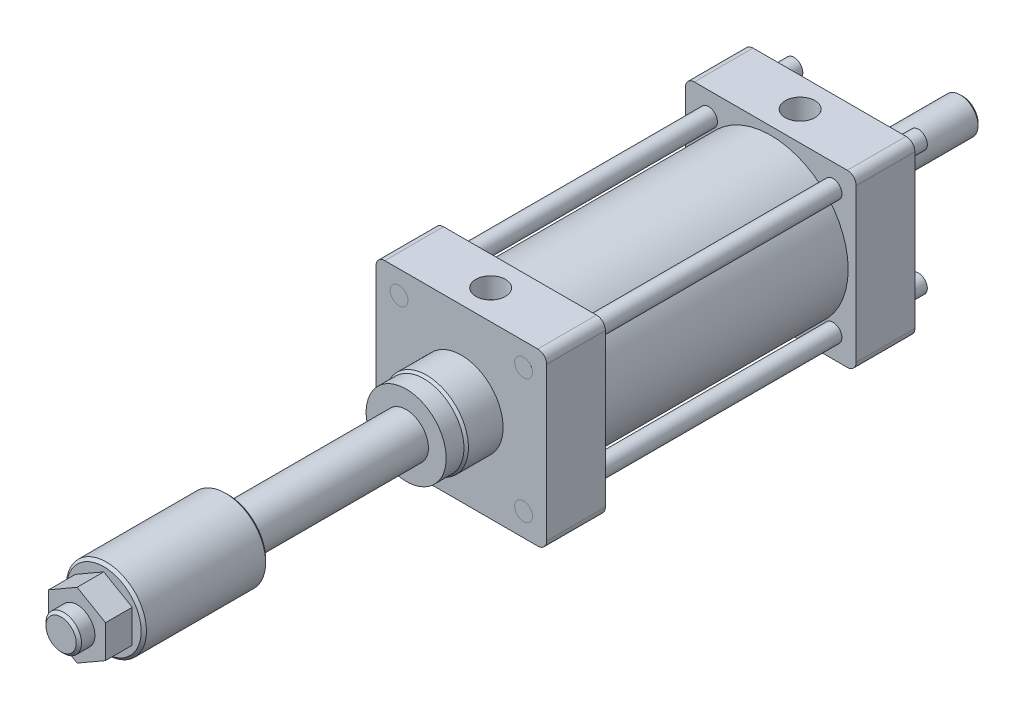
ISO-10303-21;
HEADER;
FILE_DESCRIPTION(('STEP AP214'),'2;1');
FILE_NAME('part.step','',(''),(''),'','','');
FILE_SCHEMA(('AUTOMOTIVE_DESIGN { 1 0 10303 214 1 1 1 1 }'));
ENDSEC;
DATA;
#1=APPLICATION_CONTEXT('core data for automotive mechanical design processes');
#2=APPLICATION_PROTOCOL_DEFINITION('international standard','automotive_design',2000,#1);
#3=PRODUCT_CONTEXT('',#1,'mechanical');
#4=PRODUCT('Part','Part','',(#3));
#5=PRODUCT_RELATED_PRODUCT_CATEGORY('part','',(#4));
#6=PRODUCT_DEFINITION_FORMATION('','',#4);
#7=PRODUCT_DEFINITION_CONTEXT('part definition',#1,'design');
#8=PRODUCT_DEFINITION('design','',#6,#7);
#9=PRODUCT_DEFINITION_SHAPE('','',#8);
#10=(LENGTH_UNIT() NAMED_UNIT(*) SI_UNIT(.MILLI.,.METRE.));
#11=(NAMED_UNIT(*) PLANE_ANGLE_UNIT() SI_UNIT($,.RADIAN.));
#12=(NAMED_UNIT(*) SI_UNIT($,.STERADIAN.) SOLID_ANGLE_UNIT());
#13=UNCERTAINTY_MEASURE_WITH_UNIT(LENGTH_MEASURE(1.E-05),#10,'distance_accuracy_value','');
#14=(GEOMETRIC_REPRESENTATION_CONTEXT(3) GLOBAL_UNCERTAINTY_ASSIGNED_CONTEXT((#13)) GLOBAL_UNIT_ASSIGNED_CONTEXT((#10,
#11,#12)) REPRESENTATION_CONTEXT('',''));
#15=CARTESIAN_POINT('',(0.,0.,0.));
#16=DIRECTION('',(0.,0.,1.));
#17=DIRECTION('',(1.,0.,0.));
#18=AXIS2_PLACEMENT_3D('',#15,#16,#17);
#19=CARTESIAN_POINT('',(-43.,43.,207.));
#20=DIRECTION('',(0.,0.,1.));
#21=DIRECTION('',(1.,0.,0.));
#22=AXIS2_PLACEMENT_3D('',#19,#20,#21);
#23=PLANE('',#22);
#24=CARTESIAN_POINT('',(35.0000000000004,34.9999999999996,207.));
#25=DIRECTION('',(0.,0.,1.));
#26=DIRECTION('',(1.,0.,0.));
#27=AXIS2_PLACEMENT_3D('',#24,#25,#26);
#28=CIRCLE('',#27,5.);
#29=CARTESIAN_POINT('',(40.0000000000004,34.9999999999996,207.));
#30=VERTEX_POINT('',#29);
#31=EDGE_CURVE('E11',#30,#30,#28,.F.);
#32=ORIENTED_EDGE('',*,*,#31,.F.);
#33=EDGE_LOOP('',(#32));
#34=FACE_BOUND('',#33,.T.);
#35=ADVANCED_FACE('F44',(#34),#23,.T.);
#36=CARTESIAN_POINT('',(35.0000000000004,34.9999999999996,221.142135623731));
#37=DIRECTION('',(0.,0.,-1.));
#38=DIRECTION('',(-1.,0.,0.));
#39=AXIS2_PLACEMENT_3D('',#36,#37,#38);
#40=CYLINDRICAL_SURFACE('',#39,5.);
#41=ORIENTED_EDGE('',*,*,#31,.T.);
#42=EDGE_LOOP('',(#41));
#43=FACE_BOUND('',#42,.T.);
#44=CARTESIAN_POINT('',(35.0000000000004,34.9999999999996,-15.));
#45=DIRECTION('',(0.,0.,-1.));
#46=DIRECTION('',(-1.,0.,0.));
#47=AXIS2_PLACEMENT_3D('',#44,#45,#46);
#48=CIRCLE('',#47,5.);
#49=CARTESIAN_POINT('',(30.0000000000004,34.9999999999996,-15.));
#50=VERTEX_POINT('',#49);
#51=EDGE_CURVE('E50',#50,#50,#48,.T.);
#52=ORIENTED_EDGE('',*,*,#51,.F.);
#53=EDGE_LOOP('',(#52));
#54=FACE_BOUND('',#53,.T.);
#55=ADVANCED_FACE('F58',(#43,#54),#40,.T.);
#56=CARTESIAN_POINT('',(35.0000000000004,34.9999999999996,-15.));
#57=DIRECTION('',(0.,0.,-1.));
#58=DIRECTION('',(-1.,0.,0.));
#59=AXIS2_PLACEMENT_3D('',#56,#57,#58);
#60=PLANE('',#59);
#61=ORIENTED_EDGE('',*,*,#51,.T.);
#62=EDGE_LOOP('',(#61));
#63=FACE_BOUND('',#62,.T.);
#64=ADVANCED_FACE('F56',(#63),#60,.T.);
#65=CLOSED_SHELL('',(#35,#55,#64));
#66=MANIFOLD_SOLID_BREP('B2',#65);
#67=CARTESIAN_POINT('',(-43.,43.,207.));
#68=DIRECTION('',(0.,0.,1.));
#69=DIRECTION('',(1.,0.,0.));
#70=AXIS2_PLACEMENT_3D('',#67,#68,#69);
#71=PLANE('',#70);
#72=CARTESIAN_POINT('',(-34.9999999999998,35.0000000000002,207.));
#73=DIRECTION('',(0.,0.,1.));
#74=DIRECTION('',(1.,0.,0.));
#75=AXIS2_PLACEMENT_3D('',#72,#73,#74);
#76=CIRCLE('',#75,5.);
#77=CARTESIAN_POINT('',(-29.9999999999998,35.0000000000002,207.));
#78=VERTEX_POINT('',#77);
#79=EDGE_CURVE('E43',#78,#78,#76,.F.);
#80=ORIENTED_EDGE('',*,*,#79,.F.);
#81=EDGE_LOOP('',(#80));
#82=FACE_BOUND('',#81,.T.);
#83=ADVANCED_FACE('F93',(#82),#71,.T.);
#84=CARTESIAN_POINT('',(-34.9999999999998,35.0000000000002,221.142135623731));
#85=DIRECTION('',(0.,0.,-1.));
#86=DIRECTION('',(-1.,0.,0.));
#87=AXIS2_PLACEMENT_3D('',#84,#85,#86);
#88=CYLINDRICAL_SURFACE('',#87,5.);
#89=ORIENTED_EDGE('',*,*,#79,.T.);
#90=EDGE_LOOP('',(#89));
#91=FACE_BOUND('',#90,.T.);
#92=CARTESIAN_POINT('',(-34.9999999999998,35.0000000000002,-15.));
#93=DIRECTION('',(0.,0.,-1.));
#94=DIRECTION('',(-1.,0.,0.));
#95=AXIS2_PLACEMENT_3D('',#92,#93,#94);
#96=CIRCLE('',#95,5.);
#97=CARTESIAN_POINT('',(-39.9999999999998,35.0000000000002,-15.));
#98=VERTEX_POINT('',#97);
#99=EDGE_CURVE('E99',#98,#98,#96,.T.);
#100=ORIENTED_EDGE('',*,*,#99,.F.);
#101=EDGE_LOOP('',(#100));
#102=FACE_BOUND('',#101,.T.);
#103=ADVANCED_FACE('F107',(#91,#102),#88,.T.);
#104=CARTESIAN_POINT('',(-34.9999999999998,35.0000000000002,-15.));
#105=DIRECTION('',(0.,0.,-1.));
#106=DIRECTION('',(-1.,0.,0.));
#107=AXIS2_PLACEMENT_3D('',#104,#105,#106);
#108=PLANE('',#107);
#109=ORIENTED_EDGE('',*,*,#99,.T.);
#110=EDGE_LOOP('',(#109));
#111=FACE_BOUND('',#110,.T.);
#112=ADVANCED_FACE('F105',(#111),#108,.T.);
#113=CLOSED_SHELL('',(#83,#103,#112));
#114=MANIFOLD_SOLID_BREP('B6',#113);
#115=CARTESIAN_POINT('',(-43.,43.,207.));
#116=DIRECTION('',(0.,0.,1.));
#117=DIRECTION('',(1.,0.,0.));
#118=AXIS2_PLACEMENT_3D('',#115,#116,#117);
#119=PLANE('',#118);
#120=CARTESIAN_POINT('',(-35.0000000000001,-34.9999999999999,207.));
#121=DIRECTION('',(0.,0.,1.));
#122=DIRECTION('',(1.,0.,0.));
#123=AXIS2_PLACEMENT_3D('',#120,#121,#122);
#124=CIRCLE('',#123,5.);
#125=CARTESIAN_POINT('',(-30.0000000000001,-34.9999999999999,207.));
#126=VERTEX_POINT('',#125);
#127=EDGE_CURVE('E92',#126,#126,#124,.F.);
#128=ORIENTED_EDGE('',*,*,#127,.F.);
#129=EDGE_LOOP('',(#128));
#130=FACE_BOUND('',#129,.T.);
#131=ADVANCED_FACE('F142',(#130),#119,.T.);
#132=CARTESIAN_POINT('',(-35.0000000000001,-34.9999999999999,221.142135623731));
#133=DIRECTION('',(0.,0.,-1.));
#134=DIRECTION('',(-1.,0.,0.));
#135=AXIS2_PLACEMENT_3D('',#132,#133,#134);
#136=CYLINDRICAL_SURFACE('',#135,5.);
#137=ORIENTED_EDGE('',*,*,#127,.T.);
#138=EDGE_LOOP('',(#137));
#139=FACE_BOUND('',#138,.T.);
#140=CARTESIAN_POINT('',(-35.0000000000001,-34.9999999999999,-15.));
#141=DIRECTION('',(0.,0.,-1.));
#142=DIRECTION('',(-1.,0.,0.));
#143=AXIS2_PLACEMENT_3D('',#140,#141,#142);
#144=CIRCLE('',#143,5.);
#145=CARTESIAN_POINT('',(-40.0000000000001,-34.9999999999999,-15.));
#146=VERTEX_POINT('',#145);
#147=EDGE_CURVE('E148',#146,#146,#144,.T.);
#148=ORIENTED_EDGE('',*,*,#147,.F.);
#149=EDGE_LOOP('',(#148));
#150=FACE_BOUND('',#149,.T.);
#151=ADVANCED_FACE('F156',(#139,#150),#136,.T.);
#152=CARTESIAN_POINT('',(-35.0000000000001,-34.9999999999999,-15.));
#153=DIRECTION('',(0.,0.,-1.));
#154=DIRECTION('',(-1.,0.,0.));
#155=AXIS2_PLACEMENT_3D('',#152,#153,#154);
#156=PLANE('',#155);
#157=ORIENTED_EDGE('',*,*,#147,.T.);
#158=EDGE_LOOP('',(#157));
#159=FACE_BOUND('',#158,.T.);
#160=ADVANCED_FACE('F154',(#159),#156,.T.);
#161=CLOSED_SHELL('',(#131,#151,#160));
#162=MANIFOLD_SOLID_BREP('B38',#161);
#163=CARTESIAN_POINT('',(-43.,43.,207.));
#164=DIRECTION('',(0.,0.,1.));
#165=DIRECTION('',(1.,0.,0.));
#166=AXIS2_PLACEMENT_3D('',#163,#164,#165);
#167=PLANE('',#166);
#168=CARTESIAN_POINT('',(35.,-35.,207.));
#169=DIRECTION('',(0.,0.,1.));
#170=DIRECTION('',(1.,0.,0.));
#171=AXIS2_PLACEMENT_3D('',#168,#169,#170);
#172=CIRCLE('',#171,5.);
#173=CARTESIAN_POINT('',(40.,-35.,207.));
#174=VERTEX_POINT('',#173);
#175=EDGE_CURVE('E141',#174,#174,#172,.F.);
#176=ORIENTED_EDGE('',*,*,#175,.F.);
#177=EDGE_LOOP('',(#176));
#178=FACE_BOUND('',#177,.T.);
#179=ADVANCED_FACE('F192',(#178),#167,.T.);
#180=CARTESIAN_POINT('',(35.,-35.,221.142135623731));
#181=DIRECTION('',(0.,0.,-1.));
#182=DIRECTION('',(-1.,0.,0.));
#183=AXIS2_PLACEMENT_3D('',#180,#181,#182);
#184=CYLINDRICAL_SURFACE('',#183,5.);
#185=ORIENTED_EDGE('',*,*,#175,.T.);
#186=EDGE_LOOP('',(#185));
#187=FACE_BOUND('',#186,.T.);
#188=CARTESIAN_POINT('',(35.,-35.,-15.));
#189=DIRECTION('',(0.,0.,-1.));
#190=DIRECTION('',(-1.,0.,0.));
#191=AXIS2_PLACEMENT_3D('',#188,#189,#190);
#192=CIRCLE('',#191,5.);
#193=CARTESIAN_POINT('',(30.,-35.,-15.));
#194=VERTEX_POINT('',#193);
#195=EDGE_CURVE('E198',#194,#194,#192,.T.);
#196=ORIENTED_EDGE('',*,*,#195,.F.);
#197=EDGE_LOOP('',(#196));
#198=FACE_BOUND('',#197,.T.);
#199=ADVANCED_FACE('F206',(#187,#198),#184,.T.);
#200=CARTESIAN_POINT('',(35.,-35.,-15.));
#201=DIRECTION('',(0.,0.,-1.));
#202=DIRECTION('',(-1.,0.,0.));
#203=AXIS2_PLACEMENT_3D('',#200,#201,#202);
#204=PLANE('',#203);
#205=ORIENTED_EDGE('',*,*,#195,.T.);
#206=EDGE_LOOP('',(#205));
#207=FACE_BOUND('',#206,.T.);
#208=ADVANCED_FACE('F204',(#207),#204,.T.);
#209=CLOSED_SHELL('',(#179,#199,#208));
#210=MANIFOLD_SOLID_BREP('B87',#209);
#211=CARTESIAN_POINT('',(0.,0.,408.));
#212=DIRECTION('',(0.,0.,1.));
#213=DIRECTION('',(1.,0.,0.));
#214=AXIS2_PLACEMENT_3D('',#211,#212,#213);
#215=PLANE('',#214);
#216=CARTESIAN_POINT('',(0.,0.,408.));
#217=DIRECTION('',(0.,0.,1.));
#218=DIRECTION('',(1.,0.,0.));
#219=AXIS2_PLACEMENT_3D('',#216,#217,#218);
#220=CIRCLE('',#219,21.);
#221=CARTESIAN_POINT('',(21.,0.,408.));
#222=VERTEX_POINT('',#221);
#223=EDGE_CURVE('E411',#222,#222,#220,.T.);
#224=ORIENTED_EDGE('',*,*,#223,.T.);
#225=EDGE_LOOP('',(#224));
#226=FACE_BOUND('',#225,.T.);
#227=DIRECTION('',(-0.866025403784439,-0.5,0.));
#228=VECTOR('',#227,1.);
#229=CARTESIAN_POINT('',(0.,18.475208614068,408.));
#230=LINE('',#229,#228);
#231=CARTESIAN_POINT('',(0.,18.475208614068,408.));
#232=VERTEX_POINT('',#231);
#233=CARTESIAN_POINT('',(-16.,9.23760430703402,408.));
#234=VERTEX_POINT('',#233);
#235=EDGE_CURVE('E979',#232,#234,#230,.T.);
#236=ORIENTED_EDGE('',*,*,#235,.F.);
#237=DIRECTION('',(-0.866025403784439,0.5,0.));
#238=VECTOR('',#237,1.);
#239=CARTESIAN_POINT('',(16.,9.23760430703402,408.));
#240=LINE('',#239,#238);
#241=CARTESIAN_POINT('',(16.,9.23760430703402,408.));
#242=VERTEX_POINT('',#241);
#243=EDGE_CURVE('E961',#242,#232,#240,.T.);
#244=ORIENTED_EDGE('',*,*,#243,.F.);
#245=DIRECTION('',(0.,1.,0.));
#246=VECTOR('',#245,1.);
#247=CARTESIAN_POINT('',(16.,-9.23760430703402,408.));
#248=LINE('',#247,#246);
#249=CARTESIAN_POINT('',(16.,-9.23760430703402,408.));
#250=VERTEX_POINT('',#249);
#251=EDGE_CURVE('E966',#250,#242,#248,.T.);
#252=ORIENTED_EDGE('',*,*,#251,.F.);
#253=DIRECTION('',(0.866025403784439,0.5,0.));
#254=VECTOR('',#253,1.);
#255=CARTESIAN_POINT('',(0.,-18.475208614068,408.));
#256=LINE('',#255,#254);
#257=CARTESIAN_POINT('',(0.,-18.475208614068,408.));
#258=VERTEX_POINT('',#257);
#259=EDGE_CURVE('E985',#258,#250,#256,.T.);
#260=ORIENTED_EDGE('',*,*,#259,.F.);
#261=DIRECTION('',(0.866025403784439,-0.5,0.));
#262=VECTOR('',#261,1.);
#263=CARTESIAN_POINT('',(-16.,-9.23760430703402,408.));
#264=LINE('',#263,#262);
#265=CARTESIAN_POINT('',(-16.,-9.23760430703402,408.));
#266=VERTEX_POINT('',#265);
#267=EDGE_CURVE('E983',#266,#258,#264,.T.);
#268=ORIENTED_EDGE('',*,*,#267,.F.);
#269=DIRECTION('',(0.,-1.,0.));
#270=VECTOR('',#269,1.);
#271=CARTESIAN_POINT('',(-16.,9.23760430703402,408.));
#272=LINE('',#271,#270);
#273=EDGE_CURVE('E981',#234,#266,#272,.T.);
#274=ORIENTED_EDGE('',*,*,#273,.F.);
#275=EDGE_LOOP('',(#236,#244,#252,#260,#268,#274));
#276=FACE_BOUND('',#275,.T.);
#277=ADVANCED_FACE('F233',(#226,#276),#215,.T.);
#278=CARTESIAN_POINT('',(-43.,43.,33.));
#279=DIRECTION('',(0.,0.,1.));
#280=DIRECTION('',(1.,0.,0.));
#281=AXIS2_PLACEMENT_3D('',#278,#279,#280);
#282=PLANE('',#281);
#283=CARTESIAN_POINT('',(0.,0.,33.));
#284=DIRECTION('',(0.,0.,1.));
#285=DIRECTION('',(1.,0.,0.));
#286=AXIS2_PLACEMENT_3D('',#283,#284,#285);
#287=CIRCLE('',#286,43.5);
#288=CARTESIAN_POINT('',(43.5,0.,33.));
#289=VERTEX_POINT('',#288);
#290=EDGE_CURVE('E752',#289,#289,#287,.T.);
#291=ORIENTED_EDGE('',*,*,#290,.F.);
#292=EDGE_LOOP('',(#291));
#293=FACE_BOUND('',#292,.T.);
#294=CARTESIAN_POINT('',(-34.9999999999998,35.0000000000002,33.));
#295=DIRECTION('',(0.,0.,1.));
#296=DIRECTION('',(1.,0.,0.));
#297=AXIS2_PLACEMENT_3D('',#294,#295,#296);
#298=CIRCLE('',#297,4.99999999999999);
#299=CARTESIAN_POINT('',(-29.9999999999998,35.0000000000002,33.));
#300=VERTEX_POINT('',#299);
#301=EDGE_CURVE('E771',#300,#300,#298,.T.);
#302=ORIENTED_EDGE('',*,*,#301,.F.);
#303=EDGE_LOOP('',(#302));
#304=FACE_BOUND('',#303,.T.);
#305=CARTESIAN_POINT('',(35.,-35.,33.));
#306=DIRECTION('',(0.,0.,1.));
#307=DIRECTION('',(1.,0.,0.));
#308=AXIS2_PLACEMENT_3D('',#305,#306,#307);
#309=CIRCLE('',#308,5.);
#310=CARTESIAN_POINT('',(40.,-35.,33.));
#311=VERTEX_POINT('',#310);
#312=EDGE_CURVE('E348',#311,#311,#309,.T.);
#313=ORIENTED_EDGE('',*,*,#312,.F.);
#314=EDGE_LOOP('',(#313));
#315=FACE_BOUND('',#314,.T.);
#316=CARTESIAN_POINT('',(-43.,43.,33.));
#317=DIRECTION('',(0.,0.,1.));
#318=DIRECTION('',(1.,0.,0.));
#319=AXIS2_PLACEMENT_3D('',#316,#317,#318);
#320=CIRCLE('',#319,5.);
#321=CARTESIAN_POINT('',(-43.,48.,33.));
#322=VERTEX_POINT('',#321);
#323=CARTESIAN_POINT('',(-48.,43.,33.));
#324=VERTEX_POINT('',#323);
#325=EDGE_CURVE('E360',#322,#324,#320,.T.);
#326=ORIENTED_EDGE('',*,*,#325,.T.);
#327=DIRECTION('',(0.,-1.,0.));
#328=VECTOR('',#327,1.);
#329=CARTESIAN_POINT('',(-48.,43.,33.));
#330=LINE('',#329,#328);
#331=CARTESIAN_POINT('',(-48.,-43.,33.));
#332=VERTEX_POINT('',#331);
#333=EDGE_CURVE('E299',#324,#332,#330,.T.);
#334=ORIENTED_EDGE('',*,*,#333,.T.);
#335=CARTESIAN_POINT('',(-43.,-43.,33.));
#336=DIRECTION('',(0.,0.,1.));
#337=DIRECTION('',(1.,0.,0.));
#338=AXIS2_PLACEMENT_3D('',#335,#336,#337);
#339=CIRCLE('',#338,5.);
#340=CARTESIAN_POINT('',(-43.,-48.,33.));
#341=VERTEX_POINT('',#340);
#342=EDGE_CURVE('E789',#332,#341,#339,.T.);
#343=ORIENTED_EDGE('',*,*,#342,.T.);
#344=DIRECTION('',(1.,0.,0.));
#345=VECTOR('',#344,1.);
#346=CARTESIAN_POINT('',(43.,-48.,33.));
#347=LINE('',#346,#345);
#348=CARTESIAN_POINT('',(43.,-48.,33.));
#349=VERTEX_POINT('',#348);
#350=EDGE_CURVE('E791',#341,#349,#347,.T.);
#351=ORIENTED_EDGE('',*,*,#350,.T.);
#352=CARTESIAN_POINT('',(43.,-43.,33.));
#353=DIRECTION('',(0.,0.,1.));
#354=DIRECTION('',(-1.,0.,0.));
#355=AXIS2_PLACEMENT_3D('',#352,#353,#354);
#356=CIRCLE('',#355,5.);
#357=CARTESIAN_POINT('',(48.,-43.,33.));
#358=VERTEX_POINT('',#357);
#359=EDGE_CURVE('E323',#349,#358,#356,.T.);
#360=ORIENTED_EDGE('',*,*,#359,.T.);
#361=DIRECTION('',(0.,1.,0.));
#362=VECTOR('',#361,1.);
#363=CARTESIAN_POINT('',(48.,43.,33.));
#364=LINE('',#363,#362);
#365=CARTESIAN_POINT('',(48.,43.,33.));
#366=VERTEX_POINT('',#365);
#367=EDGE_CURVE('E315',#358,#366,#364,.T.);
#368=ORIENTED_EDGE('',*,*,#367,.T.);
#369=CARTESIAN_POINT('',(43.,43.,33.));
#370=DIRECTION('',(0.,0.,1.));
#371=DIRECTION('',(-1.,0.,0.));
#372=AXIS2_PLACEMENT_3D('',#369,#370,#371);
#373=CIRCLE('',#372,5.);
#374=CARTESIAN_POINT('',(43.,48.,33.));
#375=VERTEX_POINT('',#374);
#376=EDGE_CURVE('E320',#366,#375,#373,.T.);
#377=ORIENTED_EDGE('',*,*,#376,.T.);
#378=DIRECTION('',(-1.,0.,0.));
#379=VECTOR('',#378,1.);
#380=CARTESIAN_POINT('',(43.,48.,33.));
#381=LINE('',#380,#379);
#382=EDGE_CURVE('E257',#375,#322,#381,.T.);
#383=ORIENTED_EDGE('',*,*,#382,.T.);
#384=EDGE_LOOP('',(#326,#334,#343,#351,#360,#368,#377,#383));
#385=FACE_BOUND('',#384,.T.);
#386=CARTESIAN_POINT('',(-35.0000000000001,-34.9999999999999,33.));
#387=DIRECTION('',(0.,0.,1.));
#388=DIRECTION('',(1.,0.,0.));
#389=AXIS2_PLACEMENT_3D('',#386,#387,#388);
#390=CIRCLE('',#389,5.);
#391=CARTESIAN_POINT('',(-30.0000000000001,-34.9999999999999,33.));
#392=VERTEX_POINT('',#391);
#393=EDGE_CURVE('E777',#392,#392,#390,.T.);
#394=ORIENTED_EDGE('',*,*,#393,.F.);
#395=EDGE_LOOP('',(#394));
#396=FACE_BOUND('',#395,.T.);
#397=CARTESIAN_POINT('',(35.0000000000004,34.9999999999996,33.));
#398=DIRECTION('',(0.,0.,1.));
#399=DIRECTION('',(1.,0.,0.));
#400=AXIS2_PLACEMENT_3D('',#397,#398,#399);
#401=CIRCLE('',#400,5.);
#402=CARTESIAN_POINT('',(40.0000000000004,34.9999999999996,33.));
#403=VERTEX_POINT('',#402);
#404=EDGE_CURVE('E765',#403,#403,#401,.T.);
#405=ORIENTED_EDGE('',*,*,#404,.F.);
#406=EDGE_LOOP('',(#405));
#407=FACE_BOUND('',#406,.T.);
#408=ADVANCED_FACE('F317',(#293,#304,#315,#385,#396,#407),#282,.T.);
#409=CARTESIAN_POINT('',(-43.,43.,0.));
#410=DIRECTION('',(0.,0.,1.));
#411=DIRECTION('',(1.,0.,0.));
#412=AXIS2_PLACEMENT_3D('',#409,#410,#411);
#413=PLANE('',#412);
#414=CARTESIAN_POINT('',(0.,0.,0.));
#415=DIRECTION('',(0.,0.,1.));
#416=DIRECTION('',(1.,0.,0.));
#417=AXIS2_PLACEMENT_3D('',#414,#415,#416);
#418=CIRCLE('',#417,23.5);
#419=CARTESIAN_POINT('',(23.5,0.,0.));
#420=VERTEX_POINT('',#419);
#421=EDGE_CURVE('E375',#420,#420,#418,.F.);
#422=ORIENTED_EDGE('',*,*,#421,.F.);
#423=EDGE_LOOP('',(#422));
#424=FACE_BOUND('',#423,.T.);
#425=CARTESIAN_POINT('',(-43.,43.,0.));
#426=DIRECTION('',(0.,0.,1.));
#427=DIRECTION('',(1.,0.,0.));
#428=AXIS2_PLACEMENT_3D('',#425,#426,#427);
#429=CIRCLE('',#428,5.);
#430=CARTESIAN_POINT('',(-43.,48.,0.));
#431=VERTEX_POINT('',#430);
#432=CARTESIAN_POINT('',(-48.,43.,0.));
#433=VERTEX_POINT('',#432);
#434=EDGE_CURVE('E344',#431,#433,#429,.T.);
#435=ORIENTED_EDGE('',*,*,#434,.F.);
#436=DIRECTION('',(-1.,0.,0.));
#437=VECTOR('',#436,1.);
#438=CARTESIAN_POINT('',(43.,48.,0.));
#439=LINE('',#438,#437);
#440=CARTESIAN_POINT('',(43.,48.,0.));
#441=VERTEX_POINT('',#440);
#442=EDGE_CURVE('E290',#441,#431,#439,.T.);
#443=ORIENTED_EDGE('',*,*,#442,.F.);
#444=CARTESIAN_POINT('',(43.,43.,0.));
#445=DIRECTION('',(0.,0.,1.));
#446=DIRECTION('',(-1.,0.,0.));
#447=AXIS2_PLACEMENT_3D('',#444,#445,#446);
#448=CIRCLE('',#447,5.);
#449=CARTESIAN_POINT('',(48.,43.,0.));
#450=VERTEX_POINT('',#449);
#451=EDGE_CURVE('E357',#450,#441,#448,.T.);
#452=ORIENTED_EDGE('',*,*,#451,.F.);
#453=DIRECTION('',(0.,1.,0.));
#454=VECTOR('',#453,1.);
#455=CARTESIAN_POINT('',(48.,43.,0.));
#456=LINE('',#455,#454);
#457=CARTESIAN_POINT('',(48.,-43.,0.));
#458=VERTEX_POINT('',#457);
#459=EDGE_CURVE('E332',#458,#450,#456,.T.);
#460=ORIENTED_EDGE('',*,*,#459,.F.);
#461=CARTESIAN_POINT('',(43.,-43.,0.));
#462=DIRECTION('',(0.,0.,1.));
#463=DIRECTION('',(-1.,0.,0.));
#464=AXIS2_PLACEMENT_3D('',#461,#462,#463);
#465=CIRCLE('',#464,5.);
#466=CARTESIAN_POINT('',(43.,-48.,0.));
#467=VERTEX_POINT('',#466);
#468=EDGE_CURVE('E354',#467,#458,#465,.T.);
#469=ORIENTED_EDGE('',*,*,#468,.F.);
#470=DIRECTION('',(1.,0.,0.));
#471=VECTOR('',#470,1.);
#472=CARTESIAN_POINT('',(43.,-48.,0.));
#473=LINE('',#472,#471);
#474=CARTESIAN_POINT('',(-43.,-48.,0.));
#475=VERTEX_POINT('',#474);
#476=EDGE_CURVE('E352',#475,#467,#473,.T.);
#477=ORIENTED_EDGE('',*,*,#476,.F.);
#478=CARTESIAN_POINT('',(-43.,-43.,0.));
#479=DIRECTION('',(0.,0.,1.));
#480=DIRECTION('',(1.,0.,0.));
#481=AXIS2_PLACEMENT_3D('',#478,#479,#480);
#482=CIRCLE('',#481,5.);
#483=CARTESIAN_POINT('',(-48.,-43.,0.));
#484=VERTEX_POINT('',#483);
#485=EDGE_CURVE('E350',#484,#475,#482,.T.);
#486=ORIENTED_EDGE('',*,*,#485,.F.);
#487=DIRECTION('',(0.,-1.,0.));
#488=VECTOR('',#487,1.);
#489=CARTESIAN_POINT('',(-48.,43.,0.));
#490=LINE('',#489,#488);
#491=EDGE_CURVE('E347',#433,#484,#490,.T.);
#492=ORIENTED_EDGE('',*,*,#491,.F.);
#493=EDGE_LOOP('',(#435,#443,#452,#460,#469,#477,#486,#492));
#494=FACE_BOUND('',#493,.T.);
#495=CARTESIAN_POINT('',(35.,-35.,0.));
#496=DIRECTION('',(0.,0.,1.));
#497=DIRECTION('',(1.,0.,0.));
#498=AXIS2_PLACEMENT_3D('',#495,#496,#497);
#499=CIRCLE('',#498,5.);
#500=CARTESIAN_POINT('',(40.,-35.,0.));
#501=VERTEX_POINT('',#500);
#502=EDGE_CURVE('E780',#501,#501,#499,.T.);
#503=ORIENTED_EDGE('',*,*,#502,.T.);
#504=EDGE_LOOP('',(#503));
#505=FACE_BOUND('',#504,.T.);
#506=CARTESIAN_POINT('',(-35.0000000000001,-34.9999999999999,0.));
#507=DIRECTION('',(0.,0.,1.));
#508=DIRECTION('',(1.,0.,0.));
#509=AXIS2_PLACEMENT_3D('',#506,#507,#508);
#510=CIRCLE('',#509,5.);
#511=CARTESIAN_POINT('',(-30.0000000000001,-34.9999999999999,0.));
#512=VERTEX_POINT('',#511);
#513=EDGE_CURVE('E774',#512,#512,#510,.T.);
#514=ORIENTED_EDGE('',*,*,#513,.T.);
#515=EDGE_LOOP('',(#514));
#516=FACE_BOUND('',#515,.T.);
#517=CARTESIAN_POINT('',(-34.9999999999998,35.0000000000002,0.));
#518=DIRECTION('',(0.,0.,1.));
#519=DIRECTION('',(1.,0.,0.));
#520=AXIS2_PLACEMENT_3D('',#517,#518,#519);
#521=CIRCLE('',#520,4.99999999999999);
#522=CARTESIAN_POINT('',(-29.9999999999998,35.0000000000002,0.));
#523=VERTEX_POINT('',#522);
#524=EDGE_CURVE('E768',#523,#523,#521,.T.);
#525=ORIENTED_EDGE('',*,*,#524,.T.);
#526=EDGE_LOOP('',(#525));
#527=FACE_BOUND('',#526,.T.);
#528=CARTESIAN_POINT('',(35.0000000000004,34.9999999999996,0.));
#529=DIRECTION('',(0.,0.,1.));
#530=DIRECTION('',(1.,0.,0.));
#531=AXIS2_PLACEMENT_3D('',#528,#529,#530);
#532=CIRCLE('',#531,5.);
#533=CARTESIAN_POINT('',(40.0000000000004,34.9999999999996,0.));
#534=VERTEX_POINT('',#533);
#535=EDGE_CURVE('E764',#534,#534,#532,.T.);
#536=ORIENTED_EDGE('',*,*,#535,.T.);
#537=EDGE_LOOP('',(#536));
#538=FACE_BOUND('',#537,.T.);
#539=ADVANCED_FACE('F440',(#424,#494,#505,#516,#527,#538),#413,.F.);
#540=CARTESIAN_POINT('',(-43.,43.,33.));
#541=DIRECTION('',(0.,0.,-1.));
#542=DIRECTION('',(-1.,0.,0.));
#543=AXIS2_PLACEMENT_3D('',#540,#541,#542);
#544=CYLINDRICAL_SURFACE('',#543,5.);
#545=ORIENTED_EDGE('',*,*,#434,.T.);
#546=DIRECTION('',(0.,0.,-1.));
#547=VECTOR('',#546,1.);
#548=CARTESIAN_POINT('',(-48.,43.,33.));
#549=LINE('',#548,#547);
#550=EDGE_CURVE('E373',#324,#433,#549,.T.);
#551=ORIENTED_EDGE('',*,*,#550,.F.);
#552=ORIENTED_EDGE('',*,*,#325,.F.);
#553=DIRECTION('',(0.,0.,-1.));
#554=VECTOR('',#553,1.);
#555=CARTESIAN_POINT('',(-43.,48.,33.));
#556=LINE('',#555,#554);
#557=EDGE_CURVE('E340',#322,#431,#556,.T.);
#558=ORIENTED_EDGE('',*,*,#557,.T.);
#559=EDGE_LOOP('',(#545,#551,#552,#558));
#560=FACE_BOUND('',#559,.T.);
#561=ADVANCED_FACE('F581',(#560),#544,.T.);
#562=CARTESIAN_POINT('',(-48.,43.,33.));
#563=DIRECTION('',(1.,0.,0.));
#564=DIRECTION('',(0.,1.,0.));
#565=AXIS2_PLACEMENT_3D('',#562,#563,#564);
#566=PLANE('',#565);
#567=ORIENTED_EDGE('',*,*,#491,.T.);
#568=DIRECTION('',(0.,0.,-1.));
#569=VECTOR('',#568,1.);
#570=CARTESIAN_POINT('',(-48.,-43.,33.));
#571=LINE('',#570,#569);
#572=EDGE_CURVE('E370',#332,#484,#571,.T.);
#573=ORIENTED_EDGE('',*,*,#572,.F.);
#574=ORIENTED_EDGE('',*,*,#333,.F.);
#575=ORIENTED_EDGE('',*,*,#550,.T.);
#576=EDGE_LOOP('',(#567,#573,#574,#575));
#577=FACE_BOUND('',#576,.T.);
#578=ADVANCED_FACE('F601',(#577),#566,.F.);
#579=CARTESIAN_POINT('',(-43.,-43.,33.));
#580=DIRECTION('',(0.,0.,-1.));
#581=DIRECTION('',(-1.,0.,0.));
#582=AXIS2_PLACEMENT_3D('',#579,#580,#581);
#583=CYLINDRICAL_SURFACE('',#582,5.);
#584=ORIENTED_EDGE('',*,*,#485,.T.);
#585=DIRECTION('',(0.,0.,-1.));
#586=VECTOR('',#585,1.);
#587=CARTESIAN_POINT('',(-43.,-48.,33.));
#588=LINE('',#587,#586);
#589=EDGE_CURVE('E367',#341,#475,#588,.T.);
#590=ORIENTED_EDGE('',*,*,#589,.F.);
#591=ORIENTED_EDGE('',*,*,#342,.F.);
#592=ORIENTED_EDGE('',*,*,#572,.T.);
#593=EDGE_LOOP('',(#584,#590,#591,#592));
#594=FACE_BOUND('',#593,.T.);
#595=ADVANCED_FACE('F597',(#594),#583,.T.);
#596=CARTESIAN_POINT('',(43.,-48.,33.));
#597=DIRECTION('',(0.,1.,0.));
#598=DIRECTION('',(-1.,0.,0.));
#599=AXIS2_PLACEMENT_3D('',#596,#597,#598);
#600=PLANE('',#599);
#601=ORIENTED_EDGE('',*,*,#476,.T.);
#602=DIRECTION('',(0.,0.,-1.));
#603=VECTOR('',#602,1.);
#604=CARTESIAN_POINT('',(43.,-48.,33.));
#605=LINE('',#604,#603);
#606=EDGE_CURVE('E364',#349,#467,#605,.T.);
#607=ORIENTED_EDGE('',*,*,#606,.F.);
#608=ORIENTED_EDGE('',*,*,#350,.F.);
#609=ORIENTED_EDGE('',*,*,#589,.T.);
#610=EDGE_LOOP('',(#601,#607,#608,#609));
#611=FACE_BOUND('',#610,.T.);
#612=ADVANCED_FACE('F593',(#611),#600,.F.);
#613=CARTESIAN_POINT('',(43.,-43.,33.));
#614=DIRECTION('',(0.,0.,-1.));
#615=DIRECTION('',(-1.,0.,0.));
#616=AXIS2_PLACEMENT_3D('',#613,#614,#615);
#617=CYLINDRICAL_SURFACE('',#616,5.);
#618=ORIENTED_EDGE('',*,*,#468,.T.);
#619=DIRECTION('',(0.,0.,-1.));
#620=VECTOR('',#619,1.);
#621=CARTESIAN_POINT('',(48.,-43.,33.));
#622=LINE('',#621,#620);
#623=EDGE_CURVE('E335',#358,#458,#622,.T.);
#624=ORIENTED_EDGE('',*,*,#623,.F.);
#625=ORIENTED_EDGE('',*,*,#359,.F.);
#626=ORIENTED_EDGE('',*,*,#606,.T.);
#627=EDGE_LOOP('',(#618,#624,#625,#626));
#628=FACE_BOUND('',#627,.T.);
#629=ADVANCED_FACE('F590',(#628),#617,.T.);
#630=CARTESIAN_POINT('',(48.,43.,33.));
#631=DIRECTION('',(-1.,0.,0.));
#632=DIRECTION('',(0.,-1.,0.));
#633=AXIS2_PLACEMENT_3D('',#630,#631,#632);
#634=PLANE('',#633);
#635=ORIENTED_EDGE('',*,*,#459,.T.);
#636=DIRECTION('',(0.,0.,-1.));
#637=VECTOR('',#636,1.);
#638=CARTESIAN_POINT('',(48.,43.,33.));
#639=LINE('',#638,#637);
#640=EDGE_CURVE('E329',#366,#450,#639,.T.);
#641=ORIENTED_EDGE('',*,*,#640,.F.);
#642=ORIENTED_EDGE('',*,*,#367,.F.);
#643=ORIENTED_EDGE('',*,*,#623,.T.);
#644=EDGE_LOOP('',(#635,#641,#642,#643));
#645=FACE_BOUND('',#644,.T.);
#646=ADVANCED_FACE('F330',(#645),#634,.F.);
#647=CARTESIAN_POINT('',(43.,43.,33.));
#648=DIRECTION('',(0.,0.,-1.));
#649=DIRECTION('',(-1.,0.,0.));
#650=AXIS2_PLACEMENT_3D('',#647,#648,#649);
#651=CYLINDRICAL_SURFACE('',#650,5.);
#652=ORIENTED_EDGE('',*,*,#451,.T.);
#653=DIRECTION('',(0.,0.,-1.));
#654=VECTOR('',#653,1.);
#655=CARTESIAN_POINT('',(43.,48.,33.));
#656=LINE('',#655,#654);
#657=EDGE_CURVE('E336',#375,#441,#656,.T.);
#658=ORIENTED_EDGE('',*,*,#657,.F.);
#659=ORIENTED_EDGE('',*,*,#376,.F.);
#660=ORIENTED_EDGE('',*,*,#640,.T.);
#661=EDGE_LOOP('',(#652,#658,#659,#660));
#662=FACE_BOUND('',#661,.T.);
#663=ADVANCED_FACE('F338',(#662),#651,.T.);
#664=CARTESIAN_POINT('',(43.,48.,33.));
#665=DIRECTION('',(0.,-1.,0.));
#666=DIRECTION('',(1.,0.,0.));
#667=AXIS2_PLACEMENT_3D('',#664,#665,#666);
#668=PLANE('',#667);
#669=CARTESIAN_POINT('',(0.,48.,16.5));
#670=DIRECTION('',(0.,1.,0.));
#671=DIRECTION('',(0.,0.,1.));
#672=AXIS2_PLACEMENT_3D('',#669,#670,#671);
#673=CIRCLE('',#672,8.331);
#674=CARTESIAN_POINT('',(0.,48.,24.831));
#675=VERTEX_POINT('',#674);
#676=EDGE_CURVE('E1354',#675,#675,#673,.T.);
#677=ORIENTED_EDGE('',*,*,#676,.F.);
#678=EDGE_LOOP('',(#677));
#679=FACE_BOUND('',#678,.T.);
#680=ORIENTED_EDGE('',*,*,#442,.T.);
#681=ORIENTED_EDGE('',*,*,#557,.F.);
#682=ORIENTED_EDGE('',*,*,#382,.F.);
#683=ORIENTED_EDGE('',*,*,#657,.T.);
#684=EDGE_LOOP('',(#680,#681,#682,#683));
#685=FACE_BOUND('',#684,.T.);
#686=ADVANCED_FACE('F576',(#679,#685),#668,.F.);
#687=CARTESIAN_POINT('',(35.,-35.,33.));
#688=DIRECTION('',(0.,0.,-1.));
#689=DIRECTION('',(-1.,0.,0.));
#690=AXIS2_PLACEMENT_3D('',#687,#688,#689);
#691=CYLINDRICAL_SURFACE('',#690,5.);
#692=ORIENTED_EDGE('',*,*,#312,.T.);
#693=EDGE_LOOP('',(#692));
#694=FACE_BOUND('',#693,.T.);
#695=ORIENTED_EDGE('',*,*,#502,.F.);
#696=EDGE_LOOP('',(#695));
#697=FACE_BOUND('',#696,.T.);
#698=ADVANCED_FACE('F573',(#694,#697),#691,.F.);
#699=CARTESIAN_POINT('',(-35.0000000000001,-34.9999999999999,33.));
#700=DIRECTION('',(0.,0.,-1.));
#701=DIRECTION('',(-1.,0.,0.));
#702=AXIS2_PLACEMENT_3D('',#699,#700,#701);
#703=CYLINDRICAL_SURFACE('',#702,5.);
#704=ORIENTED_EDGE('',*,*,#393,.T.);
#705=EDGE_LOOP('',(#704));
#706=FACE_BOUND('',#705,.T.);
#707=ORIENTED_EDGE('',*,*,#513,.F.);
#708=EDGE_LOOP('',(#707));
#709=FACE_BOUND('',#708,.T.);
#710=ADVANCED_FACE('F569',(#706,#709),#703,.F.);
#711=CARTESIAN_POINT('',(-34.9999999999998,35.0000000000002,33.));
#712=DIRECTION('',(0.,0.,-1.));
#713=DIRECTION('',(-1.,0.,0.));
#714=AXIS2_PLACEMENT_3D('',#711,#712,#713);
#715=CYLINDRICAL_SURFACE('',#714,4.99999999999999);
#716=ORIENTED_EDGE('',*,*,#301,.T.);
#717=EDGE_LOOP('',(#716));
#718=FACE_BOUND('',#717,.T.);
#719=ORIENTED_EDGE('',*,*,#524,.F.);
#720=EDGE_LOOP('',(#719));
#721=FACE_BOUND('',#720,.T.);
#722=ADVANCED_FACE('F565',(#718,#721),#715,.F.);
#723=CARTESIAN_POINT('',(35.0000000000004,34.9999999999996,33.));
#724=DIRECTION('',(0.,0.,-1.));
#725=DIRECTION('',(-1.,0.,0.));
#726=AXIS2_PLACEMENT_3D('',#723,#724,#725);
#727=CYLINDRICAL_SURFACE('',#726,5.);
#728=ORIENTED_EDGE('',*,*,#404,.T.);
#729=EDGE_LOOP('',(#728));
#730=FACE_BOUND('',#729,.T.);
#731=ORIENTED_EDGE('',*,*,#535,.F.);
#732=EDGE_LOOP('',(#731));
#733=FACE_BOUND('',#732,.T.);
#734=ADVANCED_FACE('F561',(#730,#733),#727,.F.);
#735=CARTESIAN_POINT('',(0.,0.,-21.));
#736=DIRECTION('',(0.,0.,1.));
#737=DIRECTION('',(1.,0.,0.));
#738=AXIS2_PLACEMENT_3D('',#735,#736,#737);
#739=CYLINDRICAL_SURFACE('',#738,23.5);
#740=CARTESIAN_POINT('',(0.,0.,-19.5000000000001));
#741=DIRECTION('',(0.,0.,-1.));
#742=DIRECTION('',(-1.,0.,0.));
#743=AXIS2_PLACEMENT_3D('',#740,#741,#742);
#744=CIRCLE('',#743,23.5);
#745=CARTESIAN_POINT('',(23.5,0.,-19.5000000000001));
#746=VERTEX_POINT('',#745);
#747=EDGE_CURVE('E393',#746,#746,#744,.F.);
#748=CARTESIAN_POINT('',(23.5,0.,-19.5000000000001));
#749=CARTESIAN_POINT('',(23.5,0.,-19.2968750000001));
#750=CARTESIAN_POINT('',(23.5,0.,-19.0937500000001));
#751=CARTESIAN_POINT('',(23.5,0.,-18.6875000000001));
#752=CARTESIAN_POINT('',(23.5,0.,-18.4843750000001));
#753=CARTESIAN_POINT('',(23.5,0.,-18.0781250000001));
#754=CARTESIAN_POINT('',(23.5,0.,-17.8750000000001));
#755=CARTESIAN_POINT('',(23.5,0.,-17.4687500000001));
#756=CARTESIAN_POINT('',(23.5,0.,-17.2656250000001));
#757=CARTESIAN_POINT('',(23.5,0.,-16.8593750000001));
#758=CARTESIAN_POINT('',(23.5,0.,-16.6562500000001));
#759=CARTESIAN_POINT('',(23.5,0.,-16.2500000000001));
#760=CARTESIAN_POINT('',(23.5,0.,-16.0468750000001));
#761=CARTESIAN_POINT('',(23.5,0.,-15.6406250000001));
#762=CARTESIAN_POINT('',(23.5,0.,-15.4375000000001));
#763=CARTESIAN_POINT('',(23.5,0.,-15.0312500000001));
#764=CARTESIAN_POINT('',(23.5,0.,-14.8281250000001));
#765=CARTESIAN_POINT('',(23.5,0.,-14.4218750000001));
#766=CARTESIAN_POINT('',(23.5,0.,-14.2187500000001));
#767=CARTESIAN_POINT('',(23.5,0.,-13.8125000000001));
#768=CARTESIAN_POINT('',(23.5,0.,-13.6093750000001));
#769=CARTESIAN_POINT('',(23.5,0.,-13.2031250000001));
#770=CARTESIAN_POINT('',(23.5,0.,-13.0000000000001));
#771=CARTESIAN_POINT('',(23.5,0.,-12.5937500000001));
#772=CARTESIAN_POINT('',(23.5,0.,-12.3906250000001));
#773=CARTESIAN_POINT('',(23.5,0.,-11.9843750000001));
#774=CARTESIAN_POINT('',(23.5,0.,-11.7812500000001));
#775=CARTESIAN_POINT('',(23.5,0.,-11.3750000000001));
#776=CARTESIAN_POINT('',(23.5,0.,-11.1718750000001));
#777=CARTESIAN_POINT('',(23.5,0.,-10.7656250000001));
#778=CARTESIAN_POINT('',(23.5,0.,-10.5625000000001));
#779=CARTESIAN_POINT('',(23.5,0.,-10.1562500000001));
#780=CARTESIAN_POINT('',(23.5,0.,-9.95312500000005));
#781=CARTESIAN_POINT('',(23.5,0.,-9.54687500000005));
#782=CARTESIAN_POINT('',(23.5,0.,-9.34375000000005));
#783=CARTESIAN_POINT('',(23.5,0.,-8.93750000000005));
#784=CARTESIAN_POINT('',(23.5,0.,-8.73437500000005));
#785=CARTESIAN_POINT('',(23.5,0.,-8.32812500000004));
#786=CARTESIAN_POINT('',(23.5,0.,-8.12500000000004));
#787=CARTESIAN_POINT('',(23.5,0.,-7.71875000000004));
#788=CARTESIAN_POINT('',(23.5,0.,-7.51562500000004));
#789=CARTESIAN_POINT('',(23.5,0.,-7.10937500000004));
#790=CARTESIAN_POINT('',(23.5,0.,-6.90625000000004));
#791=CARTESIAN_POINT('',(23.5,0.,-6.50000000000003));
#792=CARTESIAN_POINT('',(23.5,0.,-6.29687500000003));
#793=CARTESIAN_POINT('',(23.5,0.,-5.89062500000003));
#794=CARTESIAN_POINT('',(23.5,0.,-5.68750000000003));
#795=CARTESIAN_POINT('',(23.5,0.,-5.28125000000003));
#796=CARTESIAN_POINT('',(23.5,0.,-5.07812500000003));
#797=CARTESIAN_POINT('',(23.5,0.,-4.67187500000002));
#798=CARTESIAN_POINT('',(23.5,0.,-4.46875000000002));
#799=CARTESIAN_POINT('',(23.5,0.,-4.06250000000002));
#800=CARTESIAN_POINT('',(23.5,0.,-3.85937500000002));
#801=CARTESIAN_POINT('',(23.5,0.,-3.45312500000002));
#802=CARTESIAN_POINT('',(23.5,0.,-3.25000000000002));
#803=CARTESIAN_POINT('',(23.5,0.,-2.84375000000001));
#804=CARTESIAN_POINT('',(23.5,0.,-2.64062500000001));
#805=CARTESIAN_POINT('',(23.5,0.,-2.23437500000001));
#806=CARTESIAN_POINT('',(23.5,0.,-2.03125000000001));
#807=CARTESIAN_POINT('',(23.5,0.,-1.62500000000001));
#808=CARTESIAN_POINT('',(23.5,0.,-1.42187500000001));
#809=CARTESIAN_POINT('',(23.5,0.,-1.015625));
#810=CARTESIAN_POINT('',(23.5,0.,-0.812500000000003));
#811=CARTESIAN_POINT('',(23.5,0.,-0.406250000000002));
#812=CARTESIAN_POINT('',(23.5,0.,-0.203125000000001));
#813=CARTESIAN_POINT('',(23.5,0.,0.));
#814=B_SPLINE_CURVE_WITH_KNOTS('',3,(#748,#749,#750,#751,#752,#753,#754,#755,#756,#757,#758,
#759,#760,#761,#762,#763,#764,#765,#766,#767,#768,#769,#770,#771,#772,#773,#774,#775,#776,#777,
#778,#779,#780,#781,#782,#783,#784,#785,#786,#787,#788,#789,#790,#791,#792,#793,#794,#795,#796,
#797,#798,#799,#800,#801,#802,#803,#804,#805,#806,#807,#808,#809,#810,#811,#812,#813),
.UNSPECIFIED.,.F.,.F.,(4,2,2,2,2,2,2,2,2,2,2,2,2,2,2,2,2,2,2,2,2,2,2,2,2,2,2,2,2,2,2,2,4),(0.,
0.609375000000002,1.21875,1.82812500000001,2.43750000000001,3.04687500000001,3.65625000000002,
4.26562500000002,4.87500000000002,5.48437500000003,6.09375000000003,6.70312500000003,
7.31250000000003,7.92187500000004,8.53125000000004,9.14062500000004,9.75000000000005,10.359375,
10.9687500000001,11.5781250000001,12.1875000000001,12.7968750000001,13.4062500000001,
14.0156250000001,14.6250000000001,15.2343750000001,15.8437500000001,16.4531250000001,
17.0625000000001,17.6718750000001,18.2812500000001,18.8906250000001,19.5000000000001),.UNSPECIFIED.);
#815=EDGE_CURVE('BSEAM557',#746,#420,#814,.T.);
#816=ORIENTED_EDGE('',*,*,#747,.T.);
#817=ORIENTED_EDGE('',*,*,#421,.T.);
#818=ORIENTED_EDGE('',*,*,#815,.T.);
#819=ORIENTED_EDGE('',*,*,#815,.F.);
#820=EDGE_LOOP('',(#816,#818,#817,#819));
#821=FACE_BOUND('',#820,.T.);
#822=ADVANCED_FACE('F557',(#821),#739,.T.);
#823=CARTESIAN_POINT('',(0.,0.,-21.));
#824=DIRECTION('',(0.,0.,-1.));
#825=DIRECTION('',(-1.,0.,0.));
#826=AXIS2_PLACEMENT_3D('',#823,#824,#825);
#827=PLANE('',#826);
#828=CARTESIAN_POINT('',(0.,0.,-21.));
#829=DIRECTION('',(0.,0.,-1.));
#830=DIRECTION('',(-1.,0.,0.));
#831=AXIS2_PLACEMENT_3D('',#828,#829,#830);
#832=CIRCLE('',#831,22.0000000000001);
#833=CARTESIAN_POINT('',(22.0000000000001,0.,-21.));
#834=VERTEX_POINT('',#833);
#835=EDGE_CURVE('E390',#834,#834,#832,.T.);
#836=ORIENTED_EDGE('',*,*,#835,.T.);
#837=EDGE_LOOP('',(#836));
#838=FACE_BOUND('',#837,.T.);
#839=CARTESIAN_POINT('',(0.,0.,-21.));
#840=DIRECTION('',(0.,0.,-1.));
#841=DIRECTION('',(-1.,0.,0.));
#842=AXIS2_PLACEMENT_3D('',#839,#840,#841);
#843=CIRCLE('',#842,12.5);
#844=CARTESIAN_POINT('',(-12.5,0.,-21.));
#845=VERTEX_POINT('',#844);
#846=EDGE_CURVE('E761',#845,#845,#843,.T.);
#847=ORIENTED_EDGE('',*,*,#846,.F.);
#848=EDGE_LOOP('',(#847));
#849=FACE_BOUND('',#848,.T.);
#850=ADVANCED_FACE('F553',(#838,#849),#827,.T.);
#851=CARTESIAN_POINT('',(0.,0.,-35.));
#852=DIRECTION('',(0.,0.,1.));
#853=DIRECTION('',(1.,0.,0.));
#854=AXIS2_PLACEMENT_3D('',#851,#852,#853);
#855=CYLINDRICAL_SURFACE('',#854,12.5);
#856=CARTESIAN_POINT('',(0.,0.,-33.5));
#857=DIRECTION('',(0.,0.,-1.));
#858=DIRECTION('',(-1.,0.,0.));
#859=AXIS2_PLACEMENT_3D('',#856,#857,#858);
#860=CIRCLE('',#859,12.5);
#861=CARTESIAN_POINT('',(12.5,0.,-33.5));
#862=VERTEX_POINT('',#861);
#863=EDGE_CURVE('E387',#862,#862,#860,.F.);
#864=ORIENTED_EDGE('',*,*,#863,.T.);
#865=EDGE_LOOP('',(#864));
#866=FACE_BOUND('',#865,.T.);
#867=ORIENTED_EDGE('',*,*,#846,.T.);
#868=EDGE_LOOP('',(#867));
#869=FACE_BOUND('',#868,.T.);
#870=ADVANCED_FACE('F549',(#866,#869),#855,.T.);
#871=CARTESIAN_POINT('',(0.,0.,-35.));
#872=DIRECTION('',(0.,0.,-1.));
#873=DIRECTION('',(-1.,0.,0.));
#874=AXIS2_PLACEMENT_3D('',#871,#872,#873);
#875=PLANE('',#874);
#876=CARTESIAN_POINT('',(0.,0.,-35.));
#877=DIRECTION('',(0.,0.,-1.));
#878=DIRECTION('',(-1.,0.,0.));
#879=AXIS2_PLACEMENT_3D('',#876,#877,#878);
#880=CIRCLE('',#879,11.);
#881=CARTESIAN_POINT('',(11.,0.,-35.));
#882=VERTEX_POINT('',#881);
#883=EDGE_CURVE('E384',#882,#882,#880,.T.);
#884=ORIENTED_EDGE('',*,*,#883,.T.);
#885=EDGE_LOOP('',(#884));
#886=FACE_BOUND('',#885,.T.);
#887=CARTESIAN_POINT('',(0.,0.,-35.));
#888=DIRECTION('',(0.,0.,-1.));
#889=DIRECTION('',(-1.,0.,0.));
#890=AXIS2_PLACEMENT_3D('',#887,#888,#889);
#891=CIRCLE('',#890,10.);
#892=CARTESIAN_POINT('',(-10.,0.,-35.));
#893=VERTEX_POINT('',#892);
#894=EDGE_CURVE('E756',#893,#893,#891,.T.);
#895=ORIENTED_EDGE('',*,*,#894,.F.);
#896=EDGE_LOOP('',(#895));
#897=FACE_BOUND('',#896,.T.);
#898=ADVANCED_FACE('F545',(#886,#897),#875,.T.);
#899=CARTESIAN_POINT('',(0.,0.,-75.));
#900=DIRECTION('',(0.,0.,1.));
#901=DIRECTION('',(1.,0.,0.));
#902=AXIS2_PLACEMENT_3D('',#899,#900,#901);
#903=CYLINDRICAL_SURFACE('',#902,10.);
#904=CARTESIAN_POINT('',(0.,0.,-73.5));
#905=DIRECTION('',(0.,0.,-1.));
#906=DIRECTION('',(-1.,0.,0.));
#907=AXIS2_PLACEMENT_3D('',#904,#905,#906);
#908=CIRCLE('',#907,10.);
#909=CARTESIAN_POINT('',(-10.,0.,-73.5));
#910=VERTEX_POINT('',#909);
#911=EDGE_CURVE('E381',#910,#910,#908,.F.);
#912=ORIENTED_EDGE('',*,*,#911,.T.);
#913=EDGE_LOOP('',(#912));
#914=FACE_BOUND('',#913,.T.);
#915=ORIENTED_EDGE('',*,*,#894,.T.);
#916=EDGE_LOOP('',(#915));
#917=FACE_BOUND('',#916,.T.);
#918=ADVANCED_FACE('F541',(#914,#917),#903,.T.);
#919=CARTESIAN_POINT('',(0.,0.,-75.));
#920=DIRECTION('',(0.,0.,-1.));
#921=DIRECTION('',(-1.,0.,0.));
#922=AXIS2_PLACEMENT_3D('',#919,#920,#921);
#923=PLANE('',#922);
#924=CARTESIAN_POINT('',(0.,0.,-75.));
#925=DIRECTION('',(0.,0.,-1.));
#926=DIRECTION('',(-1.,0.,0.));
#927=AXIS2_PLACEMENT_3D('',#924,#925,#926);
#928=CIRCLE('',#927,8.50000000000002);
#929=CARTESIAN_POINT('',(-8.50000000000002,0.,-75.));
#930=VERTEX_POINT('',#929);
#931=EDGE_CURVE('E378',#930,#930,#928,.T.);
#932=ORIENTED_EDGE('',*,*,#931,.T.);
#933=EDGE_LOOP('',(#932));
#934=FACE_BOUND('',#933,.T.);
#935=ADVANCED_FACE('F537',(#934),#923,.T.);
#936=CARTESIAN_POINT('',(0.,0.,-75.));
#937=DIRECTION('',(0.,0.,1.));
#938=DIRECTION('',(1.,0.,0.));
#939=AXIS2_PLACEMENT_3D('',#936,#937,#938);
#940=CONICAL_SURFACE('',#939,8.50000000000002,0.785398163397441);
#941=ORIENTED_EDGE('',*,*,#911,.F.);
#942=EDGE_LOOP('',(#941));
#943=FACE_BOUND('',#942,.T.);
#944=ORIENTED_EDGE('',*,*,#931,.F.);
#945=EDGE_LOOP('',(#944));
#946=FACE_BOUND('',#945,.T.);
#947=ADVANCED_FACE('F540',(#943,#946),#940,.T.);
#948=CARTESIAN_POINT('',(0.,0.,-35.));
#949=DIRECTION('',(0.,0.,1.));
#950=DIRECTION('',(1.,0.,0.));
#951=AXIS2_PLACEMENT_3D('',#948,#949,#950);
#952=CONICAL_SURFACE('',#951,11.,0.785398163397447);
#953=CARTESIAN_POINT('',(12.5,0.,-33.5));
#954=CARTESIAN_POINT('',(12.484375,0.,-33.515625));
#955=CARTESIAN_POINT('',(12.46875,0.,-33.53125));
#956=CARTESIAN_POINT('',(12.4375,0.,-33.5625));
#957=CARTESIAN_POINT('',(12.421875,0.,-33.578125));
#958=CARTESIAN_POINT('',(12.390625,0.,-33.609375));
#959=CARTESIAN_POINT('',(12.375,0.,-33.625));
#960=CARTESIAN_POINT('',(12.34375,0.,-33.65625));
#961=CARTESIAN_POINT('',(12.328125,0.,-33.671875));
#962=CARTESIAN_POINT('',(12.296875,0.,-33.703125));
#963=CARTESIAN_POINT('',(12.28125,0.,-33.71875));
#964=CARTESIAN_POINT('',(12.25,0.,-33.75));
#965=CARTESIAN_POINT('',(12.234375,0.,-33.765625));
#966=CARTESIAN_POINT('',(12.203125,0.,-33.796875));
#967=CARTESIAN_POINT('',(12.1875,0.,-33.8125));
#968=CARTESIAN_POINT('',(12.15625,0.,-33.84375));
#969=CARTESIAN_POINT('',(12.140625,0.,-33.859375));
#970=CARTESIAN_POINT('',(12.109375,0.,-33.890625));
#971=CARTESIAN_POINT('',(12.09375,0.,-33.90625));
#972=CARTESIAN_POINT('',(12.0625,0.,-33.9375));
#973=CARTESIAN_POINT('',(12.046875,0.,-33.953125));
#974=CARTESIAN_POINT('',(12.015625,0.,-33.984375));
#975=CARTESIAN_POINT('',(12.,0.,-34.));
#976=CARTESIAN_POINT('',(11.96875,0.,-34.03125));
#977=CARTESIAN_POINT('',(11.953125,0.,-34.046875));
#978=CARTESIAN_POINT('',(11.921875,0.,-34.078125));
#979=CARTESIAN_POINT('',(11.90625,0.,-34.09375));
#980=CARTESIAN_POINT('',(11.875,0.,-34.125));
#981=CARTESIAN_POINT('',(11.859375,0.,-34.140625));
#982=CARTESIAN_POINT('',(11.828125,0.,-34.171875));
#983=CARTESIAN_POINT('',(11.8125,0.,-34.1875));
#984=CARTESIAN_POINT('',(11.78125,0.,-34.21875));
#985=CARTESIAN_POINT('',(11.765625,0.,-34.234375));
#986=CARTESIAN_POINT('',(11.734375,0.,-34.265625));
#987=CARTESIAN_POINT('',(11.71875,0.,-34.28125));
#988=CARTESIAN_POINT('',(11.6875,0.,-34.3125));
#989=CARTESIAN_POINT('',(11.671875,0.,-34.328125));
#990=CARTESIAN_POINT('',(11.640625,0.,-34.359375));
#991=CARTESIAN_POINT('',(11.625,0.,-34.375));
#992=CARTESIAN_POINT('',(11.59375,0.,-34.40625));
#993=CARTESIAN_POINT('',(11.578125,0.,-34.421875));
#994=CARTESIAN_POINT('',(11.546875,0.,-34.453125));
#995=CARTESIAN_POINT('',(11.53125,0.,-34.46875));
#996=CARTESIAN_POINT('',(11.5,0.,-34.5));
#997=CARTESIAN_POINT('',(11.484375,0.,-34.515625));
#998=CARTESIAN_POINT('',(11.453125,0.,-34.546875));
#999=CARTESIAN_POINT('',(11.4375,0.,-34.5625));
#1000=CARTESIAN_POINT('',(11.40625,0.,-34.59375));
#1001=CARTESIAN_POINT('',(11.390625,0.,-34.609375));
#1002=CARTESIAN_POINT('',(11.359375,0.,-34.640625));
#1003=CARTESIAN_POINT('',(11.34375,0.,-34.65625));
#1004=CARTESIAN_POINT('',(11.3125,0.,-34.6875));
#1005=CARTESIAN_POINT('',(11.296875,0.,-34.703125));
#1006=CARTESIAN_POINT('',(11.265625,0.,-34.734375));
#1007=CARTESIAN_POINT('',(11.25,0.,-34.75));
#1008=CARTESIAN_POINT('',(11.21875,0.,-34.78125));
#1009=CARTESIAN_POINT('',(11.203125,0.,-34.796875));
#1010=CARTESIAN_POINT('',(11.171875,0.,-34.828125));
#1011=CARTESIAN_POINT('',(11.15625,0.,-34.84375));
#1012=CARTESIAN_POINT('',(11.125,0.,-34.875));
#1013=CARTESIAN_POINT('',(11.109375,0.,-34.890625));
#1014=CARTESIAN_POINT('',(11.078125,0.,-34.921875));
#1015=CARTESIAN_POINT('',(11.0625,0.,-34.9375));
#1016=CARTESIAN_POINT('',(11.03125,0.,-34.96875));
#1017=CARTESIAN_POINT('',(11.015625,0.,-34.984375));
#1018=CARTESIAN_POINT('',(11.,0.,-35.));
#1019=B_SPLINE_CURVE_WITH_KNOTS('',3,(#953,#954,#955,#956,#957,#958,#959,#960,#961,#962,#963,
#964,#965,#966,#967,#968,#969,#970,#971,#972,#973,#974,#975,#976,#977,#978,#979,#980,#981,#982,
#983,#984,#985,#986,#987,#988,#989,#990,#991,#992,#993,#994,#995,#996,#997,#998,#999,#1000,
#1001,#1002,#1003,#1004,#1005,#1006,#1007,#1008,#1009,#1010,#1011,#1012,#1013,#1014,#1015,#1016,
#1017,#1018),.UNSPECIFIED.,.F.,.F.,(4,2,2,2,2,2,2,2,2,2,2,2,2,2,2,2,2,2,2,2,2,2,2,2,2,2,2,2,2,2,
2,2,4),(0.,0.0662912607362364,0.132582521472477,0.198873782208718,0.265165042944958,
0.331456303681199,0.397747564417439,0.464038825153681,0.530330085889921,0.596621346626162,
0.662912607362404,0.729203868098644,0.79549512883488,0.86178638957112,0.928077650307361,
0.994368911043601,1.06066017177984,1.12695143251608,1.19324269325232,1.25953395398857,
1.32582521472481,1.39211647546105,1.45840773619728,1.52469899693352,1.59099025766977,
1.65728151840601,1.72357277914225,1.78986403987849,1.85615530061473,1.92244656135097,
1.98873782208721,2.05502908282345,2.12132034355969),.UNSPECIFIED.);
#1020=EDGE_CURVE('BSEAM610',#862,#882,#1019,.T.);
#1021=ORIENTED_EDGE('',*,*,#863,.F.);
#1022=ORIENTED_EDGE('',*,*,#883,.F.);
#1023=ORIENTED_EDGE('',*,*,#1020,.T.);
#1024=ORIENTED_EDGE('',*,*,#1020,.F.);
#1025=EDGE_LOOP('',(#1021,#1023,#1022,#1024));
#1026=FACE_BOUND('',#1025,.T.);
#1027=ADVANCED_FACE('F610',(#1026),#952,.T.);
#1028=CARTESIAN_POINT('',(0.,0.,-21.));
#1029=DIRECTION('',(0.,0.,1.));
#1030=DIRECTION('',(1.,0.,0.));
#1031=AXIS2_PLACEMENT_3D('',#1028,#1029,#1030);
#1032=CONICAL_SURFACE('',#1031,22.0000000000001,0.785398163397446);
#1033=CARTESIAN_POINT('',(23.5,0.,-19.5000000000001));
#1034=CARTESIAN_POINT('',(23.484375,0.,-19.5156250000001));
#1035=CARTESIAN_POINT('',(23.46875,0.,-19.5312500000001));
#1036=CARTESIAN_POINT('',(23.4375,0.,-19.5625000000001));
#1037=CARTESIAN_POINT('',(23.421875,0.,-19.5781250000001));
#1038=CARTESIAN_POINT('',(23.390625,0.,-19.6093750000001));
#1039=CARTESIAN_POINT('',(23.375,0.,-19.6250000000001));
#1040=CARTESIAN_POINT('',(23.34375,0.,-19.6562500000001));
#1041=CARTESIAN_POINT('',(23.328125,0.,-19.6718750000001));
#1042=CARTESIAN_POINT('',(23.296875,0.,-19.7031250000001));
#1043=CARTESIAN_POINT('',(23.28125,0.,-19.7187500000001));
#1044=CARTESIAN_POINT('',(23.25,0.,-19.7500000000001));
#1045=CARTESIAN_POINT('',(23.234375,0.,-19.7656250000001));
#1046=CARTESIAN_POINT('',(23.203125,0.,-19.7968750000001));
#1047=CARTESIAN_POINT('',(23.1875,0.,-19.8125000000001));
#1048=CARTESIAN_POINT('',(23.15625,0.,-19.8437500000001));
#1049=CARTESIAN_POINT('',(23.140625,0.,-19.8593750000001));
#1050=CARTESIAN_POINT('',(23.109375,0.,-19.8906250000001));
#1051=CARTESIAN_POINT('',(23.09375,0.,-19.9062500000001));
#1052=CARTESIAN_POINT('',(23.0625,0.,-19.9375000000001));
#1053=CARTESIAN_POINT('',(23.046875,0.,-19.9531250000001));
#1054=CARTESIAN_POINT('',(23.015625,0.,-19.9843750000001));
#1055=CARTESIAN_POINT('',(23.,0.,-20.0000000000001));
#1056=CARTESIAN_POINT('',(22.96875,0.,-20.0312500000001));
#1057=CARTESIAN_POINT('',(22.953125,0.,-20.0468750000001));
#1058=CARTESIAN_POINT('',(22.921875,0.,-20.0781250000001));
#1059=CARTESIAN_POINT('',(22.90625,0.,-20.0937500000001));
#1060=CARTESIAN_POINT('',(22.8750000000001,0.,-20.1250000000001));
#1061=CARTESIAN_POINT('',(22.859375,0.,-20.1406250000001));
#1062=CARTESIAN_POINT('',(22.8281250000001,0.,-20.1718750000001));
#1063=CARTESIAN_POINT('',(22.8125000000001,0.,-20.1875000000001));
#1064=CARTESIAN_POINT('',(22.7812500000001,0.,-20.21875));
#1065=CARTESIAN_POINT('',(22.7656250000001,0.,-20.234375));
#1066=CARTESIAN_POINT('',(22.7343750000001,0.,-20.265625));
#1067=CARTESIAN_POINT('',(22.7187500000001,0.,-20.28125));
#1068=CARTESIAN_POINT('',(22.6875000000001,0.,-20.3125));
#1069=CARTESIAN_POINT('',(22.6718750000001,0.,-20.328125));
#1070=CARTESIAN_POINT('',(22.6406250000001,0.,-20.359375));
#1071=CARTESIAN_POINT('',(22.6250000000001,0.,-20.375));
#1072=CARTESIAN_POINT('',(22.5937500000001,0.,-20.40625));
#1073=CARTESIAN_POINT('',(22.5781250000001,0.,-20.421875));
#1074=CARTESIAN_POINT('',(22.5468750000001,0.,-20.453125));
#1075=CARTESIAN_POINT('',(22.5312500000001,0.,-20.46875));
#1076=CARTESIAN_POINT('',(22.5000000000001,0.,-20.5));
#1077=CARTESIAN_POINT('',(22.4843750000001,0.,-20.515625));
#1078=CARTESIAN_POINT('',(22.4531250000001,0.,-20.546875));
#1079=CARTESIAN_POINT('',(22.4375000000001,0.,-20.5625));
#1080=CARTESIAN_POINT('',(22.4062500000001,0.,-20.59375));
#1081=CARTESIAN_POINT('',(22.3906250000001,0.,-20.609375));
#1082=CARTESIAN_POINT('',(22.3593750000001,0.,-20.640625));
#1083=CARTESIAN_POINT('',(22.3437500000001,0.,-20.65625));
#1084=CARTESIAN_POINT('',(22.3125000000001,0.,-20.6875));
#1085=CARTESIAN_POINT('',(22.2968750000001,0.,-20.703125));
#1086=CARTESIAN_POINT('',(22.2656250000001,0.,-20.734375));
#1087=CARTESIAN_POINT('',(22.2500000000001,0.,-20.75));
#1088=CARTESIAN_POINT('',(22.2187500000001,0.,-20.78125));
#1089=CARTESIAN_POINT('',(22.2031250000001,0.,-20.796875));
#1090=CARTESIAN_POINT('',(22.1718750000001,0.,-20.828125));
#1091=CARTESIAN_POINT('',(22.1562500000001,0.,-20.84375));
#1092=CARTESIAN_POINT('',(22.1250000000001,0.,-20.875));
#1093=CARTESIAN_POINT('',(22.1093750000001,0.,-20.890625));
#1094=CARTESIAN_POINT('',(22.0781250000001,0.,-20.921875));
#1095=CARTESIAN_POINT('',(22.0625000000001,0.,-20.9375));
#1096=CARTESIAN_POINT('',(22.0312500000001,0.,-20.96875));
#1097=CARTESIAN_POINT('',(22.0156250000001,0.,-20.984375));
#1098=CARTESIAN_POINT('',(22.0000000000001,0.,-21.));
#1099=B_SPLINE_CURVE_WITH_KNOTS('',3,(#1033,#1034,#1035,#1036,#1037,#1038,#1039,#1040,#1041,
#1042,#1043,#1044,#1045,#1046,#1047,#1048,#1049,#1050,#1051,#1052,#1053,#1054,#1055,#1056,#1057,
#1058,#1059,#1060,#1061,#1062,#1063,#1064,#1065,#1066,#1067,#1068,#1069,#1070,#1071,#1072,#1073,
#1074,#1075,#1076,#1077,#1078,#1079,#1080,#1081,#1082,#1083,#1084,#1085,#1086,#1087,#1088,#1089,
#1090,#1091,#1092,#1093,#1094,#1095,#1096,#1097,#1098),.UNSPECIFIED.,.F.,.F.,(4,2,2,2,2,2,2,2,2,
2,2,2,2,2,2,2,2,2,2,2,2,2,2,2,2,2,2,2,2,2,2,2,4),(0.,0.0662912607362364,0.13258252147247,
0.198873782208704,0.265165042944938,0.331456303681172,0.397747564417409,0.464038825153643,
0.530330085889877,0.596621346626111,0.662912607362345,0.729203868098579,0.795495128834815,
0.861786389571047,0.928077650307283,0.994368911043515,1.06066017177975,1.12695143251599,
1.19324269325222,1.25953395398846,1.32582521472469,1.39211647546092,1.45840773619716,
1.52469899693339,1.59099025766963,1.65728151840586,1.72357277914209,1.78986403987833,
1.85615530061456,1.9224465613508,1.98873782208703,2.05502908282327,2.1213203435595),.UNSPECIFIED.);
#1100=EDGE_CURVE('BSEAM535',#746,#834,#1099,.T.);
#1101=ORIENTED_EDGE('',*,*,#747,.F.);
#1102=ORIENTED_EDGE('',*,*,#835,.F.);
#1103=ORIENTED_EDGE('',*,*,#1100,.T.);
#1104=ORIENTED_EDGE('',*,*,#1100,.F.);
#1105=EDGE_LOOP('',(#1101,#1103,#1102,#1104));
#1106=FACE_BOUND('',#1105,.T.);
#1107=ADVANCED_FACE('F535',(#1106),#1032,.T.);
#1108=CARTESIAN_POINT('',(0.,0.,174.));
#1109=DIRECTION('',(0.,0.,-1.));
#1110=DIRECTION('',(-1.,0.,0.));
#1111=AXIS2_PLACEMENT_3D('',#1108,#1109,#1110);
#1112=CYLINDRICAL_SURFACE('',#1111,43.5);
#1113=CARTESIAN_POINT('',(0.,0.,174.));
#1114=DIRECTION('',(0.,0.,1.));
#1115=DIRECTION('',(1.,0.,0.));
#1116=AXIS2_PLACEMENT_3D('',#1113,#1114,#1115);
#1117=CIRCLE('',#1116,43.5);
#1118=CARTESIAN_POINT('',(43.5,0.,174.));
#1119=VERTEX_POINT('',#1118);
#1120=EDGE_CURVE('E753',#1119,#1119,#1117,.T.);
#1121=ORIENTED_EDGE('',*,*,#1120,.F.);
#1122=EDGE_LOOP('',(#1121));
#1123=FACE_BOUND('',#1122,.T.);
#1124=ORIENTED_EDGE('',*,*,#290,.T.);
#1125=EDGE_LOOP('',(#1124));
#1126=FACE_BOUND('',#1125,.T.);
#1127=ADVANCED_FACE('F497',(#1123,#1126),#1112,.T.);
#1128=CARTESIAN_POINT('',(-43.,43.,207.));
#1129=DIRECTION('',(0.,0.,1.));
#1130=DIRECTION('',(1.,0.,0.));
#1131=AXIS2_PLACEMENT_3D('',#1128,#1129,#1130);
#1132=PLANE('',#1131);
#1133=CARTESIAN_POINT('',(0.,0.,207.));
#1134=DIRECTION('',(0.,0.,1.));
#1135=DIRECTION('',(1.,0.,0.));
#1136=AXIS2_PLACEMENT_3D('',#1133,#1134,#1135);
#1137=CIRCLE('',#1136,23.5);
#1138=CARTESIAN_POINT('',(-23.5,0.,207.));
#1139=VERTEX_POINT('',#1138);
#1140=EDGE_CURVE('E652',#1139,#1139,#1137,.T.);
#1141=ORIENTED_EDGE('',*,*,#1140,.F.);
#1142=EDGE_LOOP('',(#1141));
#1143=FACE_BOUND('',#1142,.T.);
#1144=CARTESIAN_POINT('',(-34.9999999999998,35.0000000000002,207.));
#1145=DIRECTION('',(0.,0.,1.));
#1146=DIRECTION('',(1.,0.,0.));
#1147=AXIS2_PLACEMENT_3D('',#1144,#1145,#1146);
#1148=CIRCLE('',#1147,4.99999999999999);
#1149=CARTESIAN_POINT('',(-29.9999999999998,35.0000000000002,207.));
#1150=VERTEX_POINT('',#1149);
#1151=EDGE_CURVE('E663',#1150,#1150,#1148,.T.);
#1152=ORIENTED_EDGE('',*,*,#1151,.F.);
#1153=EDGE_LOOP('',(#1152));
#1154=FACE_BOUND('',#1153,.T.);
#1155=CARTESIAN_POINT('',(35.0000000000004,34.9999999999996,207.));
#1156=DIRECTION('',(0.,0.,1.));
#1157=DIRECTION('',(1.,0.,0.));
#1158=AXIS2_PLACEMENT_3D('',#1155,#1156,#1157);
#1159=CIRCLE('',#1158,5.);
#1160=CARTESIAN_POINT('',(40.0000000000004,34.9999999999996,207.));
#1161=VERTEX_POINT('',#1160);
#1162=EDGE_CURVE('E675',#1161,#1161,#1159,.T.);
#1163=ORIENTED_EDGE('',*,*,#1162,.F.);
#1164=EDGE_LOOP('',(#1163));
#1165=FACE_BOUND('',#1164,.T.);
#1166=CARTESIAN_POINT('',(-43.,43.,207.));
#1167=DIRECTION('',(0.,0.,1.));
#1168=DIRECTION('',(1.,0.,0.));
#1169=AXIS2_PLACEMENT_3D('',#1166,#1167,#1168);
#1170=CIRCLE('',#1169,5.);
#1171=CARTESIAN_POINT('',(-43.,48.,207.));
#1172=VERTEX_POINT('',#1171);
#1173=CARTESIAN_POINT('',(-48.,43.,207.));
#1174=VERTEX_POINT('',#1173);
#1175=EDGE_CURVE('E681',#1172,#1174,#1170,.T.);
#1176=ORIENTED_EDGE('',*,*,#1175,.T.);
#1177=DIRECTION('',(0.,-1.,0.));
#1178=VECTOR('',#1177,1.);
#1179=CARTESIAN_POINT('',(-48.,43.,207.));
#1180=LINE('',#1179,#1178);
#1181=CARTESIAN_POINT('',(-48.,-43.,207.));
#1182=VERTEX_POINT('',#1181);
#1183=EDGE_CURVE('E684',#1174,#1182,#1180,.T.);
#1184=ORIENTED_EDGE('',*,*,#1183,.T.);
#1185=CARTESIAN_POINT('',(-43.,-43.,207.));
#1186=DIRECTION('',(0.,0.,1.));
#1187=DIRECTION('',(1.,0.,0.));
#1188=AXIS2_PLACEMENT_3D('',#1185,#1186,#1187);
#1189=CIRCLE('',#1188,5.);
#1190=CARTESIAN_POINT('',(-43.,-48.,207.));
#1191=VERTEX_POINT('',#1190);
#1192=EDGE_CURVE('E688',#1182,#1191,#1189,.T.);
#1193=ORIENTED_EDGE('',*,*,#1192,.T.);
#1194=DIRECTION('',(1.,0.,0.));
#1195=VECTOR('',#1194,1.);
#1196=CARTESIAN_POINT('',(-43.,-48.,207.));
#1197=LINE('',#1196,#1195);
#1198=CARTESIAN_POINT('',(43.,-48.,207.));
#1199=VERTEX_POINT('',#1198);
#1200=EDGE_CURVE('E691',#1191,#1199,#1197,.T.);
#1201=ORIENTED_EDGE('',*,*,#1200,.T.);
#1202=CARTESIAN_POINT('',(43.,-43.,207.));
#1203=DIRECTION('',(0.,0.,1.));
#1204=DIRECTION('',(1.,0.,0.));
#1205=AXIS2_PLACEMENT_3D('',#1202,#1203,#1204);
#1206=CIRCLE('',#1205,5.);
#1207=CARTESIAN_POINT('',(48.,-43.,207.));
#1208=VERTEX_POINT('',#1207);
#1209=EDGE_CURVE('E694',#1199,#1208,#1206,.T.);
#1210=ORIENTED_EDGE('',*,*,#1209,.T.);
#1211=DIRECTION('',(0.,1.,0.));
#1212=VECTOR('',#1211,1.);
#1213=CARTESIAN_POINT('',(48.,-43.,207.));
#1214=LINE('',#1213,#1212);
#1215=CARTESIAN_POINT('',(48.,43.,207.));
#1216=VERTEX_POINT('',#1215);
#1217=EDGE_CURVE('E697',#1208,#1216,#1214,.T.);
#1218=ORIENTED_EDGE('',*,*,#1217,.T.);
#1219=CARTESIAN_POINT('',(43.,43.,207.));
#1220=DIRECTION('',(0.,0.,1.));
#1221=DIRECTION('',(1.,0.,0.));
#1222=AXIS2_PLACEMENT_3D('',#1219,#1220,#1221);
#1223=CIRCLE('',#1222,5.);
#1224=CARTESIAN_POINT('',(43.,48.,207.));
#1225=VERTEX_POINT('',#1224);
#1226=EDGE_CURVE('E700',#1216,#1225,#1223,.T.);
#1227=ORIENTED_EDGE('',*,*,#1226,.T.);
#1228=DIRECTION('',(-1.,0.,0.));
#1229=VECTOR('',#1228,1.);
#1230=CARTESIAN_POINT('',(43.,48.,207.));
#1231=LINE('',#1230,#1229);
#1232=EDGE_CURVE('E703',#1225,#1172,#1231,.T.);
#1233=ORIENTED_EDGE('',*,*,#1232,.T.);
#1234=EDGE_LOOP('',(#1176,#1184,#1193,#1201,#1210,#1218,#1227,#1233));
#1235=FACE_BOUND('',#1234,.T.);
#1236=CARTESIAN_POINT('',(35.,-35.,207.));
#1237=DIRECTION('',(0.,0.,1.));
#1238=DIRECTION('',(1.,0.,0.));
#1239=AXIS2_PLACEMENT_3D('',#1236,#1237,#1238);
#1240=CIRCLE('',#1239,5.);
#1241=CARTESIAN_POINT('',(40.,-35.,207.));
#1242=VERTEX_POINT('',#1241);
#1243=EDGE_CURVE('E669',#1242,#1242,#1240,.T.);
#1244=ORIENTED_EDGE('',*,*,#1243,.F.);
#1245=EDGE_LOOP('',(#1244));
#1246=FACE_BOUND('',#1245,.T.);
#1247=CARTESIAN_POINT('',(-35.0000000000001,-34.9999999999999,207.));
#1248=DIRECTION('',(0.,0.,1.));
#1249=DIRECTION('',(1.,0.,0.));
#1250=AXIS2_PLACEMENT_3D('',#1247,#1248,#1249);
#1251=CIRCLE('',#1250,5.);
#1252=CARTESIAN_POINT('',(-30.0000000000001,-34.9999999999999,207.));
#1253=VERTEX_POINT('',#1252);
#1254=EDGE_CURVE('E657',#1253,#1253,#1251,.T.);
#1255=ORIENTED_EDGE('',*,*,#1254,.F.);
#1256=EDGE_LOOP('',(#1255));
#1257=FACE_BOUND('',#1256,.T.);
#1258=ADVANCED_FACE('F493',(#1143,#1154,#1165,#1235,#1246,#1257),#1132,.T.);
#1259=CARTESIAN_POINT('',(-43.,43.,174.));
#1260=DIRECTION('',(0.,0.,1.));
#1261=DIRECTION('',(1.,0.,0.));
#1262=AXIS2_PLACEMENT_3D('',#1259,#1260,#1261);
#1263=PLANE('',#1262);
#1264=ORIENTED_EDGE('',*,*,#1120,.T.);
#1265=EDGE_LOOP('',(#1264));
#1266=FACE_BOUND('',#1265,.T.);
#1267=CARTESIAN_POINT('',(-43.,43.,174.));
#1268=DIRECTION('',(0.,0.,1.));
#1269=DIRECTION('',(1.,0.,0.));
#1270=AXIS2_PLACEMENT_3D('',#1267,#1268,#1269);
#1271=CIRCLE('',#1270,5.);
#1272=CARTESIAN_POINT('',(-43.,48.,174.));
#1273=VERTEX_POINT('',#1272);
#1274=CARTESIAN_POINT('',(-48.,43.,174.));
#1275=VERTEX_POINT('',#1274);
#1276=EDGE_CURVE('E678',#1273,#1275,#1271,.T.);
#1277=ORIENTED_EDGE('',*,*,#1276,.F.);
#1278=DIRECTION('',(-1.,0.,0.));
#1279=VECTOR('',#1278,1.);
#1280=CARTESIAN_POINT('',(43.,48.,174.));
#1281=LINE('',#1280,#1279);
#1282=CARTESIAN_POINT('',(43.,48.,174.));
#1283=VERTEX_POINT('',#1282);
#1284=EDGE_CURVE('E685',#1283,#1273,#1281,.T.);
#1285=ORIENTED_EDGE('',*,*,#1284,.F.);
#1286=CARTESIAN_POINT('',(43.,43.,174.));
#1287=DIRECTION('',(0.,0.,1.));
#1288=DIRECTION('',(1.,0.,0.));
#1289=AXIS2_PLACEMENT_3D('',#1286,#1287,#1288);
#1290=CIRCLE('',#1289,5.);
#1291=CARTESIAN_POINT('',(48.,43.,174.));
#1292=VERTEX_POINT('',#1291);
#1293=EDGE_CURVE('E724',#1292,#1283,#1290,.T.);
#1294=ORIENTED_EDGE('',*,*,#1293,.F.);
#1295=DIRECTION('',(0.,1.,0.));
#1296=VECTOR('',#1295,1.);
#1297=CARTESIAN_POINT('',(48.,-43.,174.));
#1298=LINE('',#1297,#1296);
#1299=CARTESIAN_POINT('',(48.,-43.,174.));
#1300=VERTEX_POINT('',#1299);
#1301=EDGE_CURVE('E721',#1300,#1292,#1298,.T.);
#1302=ORIENTED_EDGE('',*,*,#1301,.F.);
#1303=CARTESIAN_POINT('',(43.,-43.,174.));
#1304=DIRECTION('',(0.,0.,1.));
#1305=DIRECTION('',(1.,0.,0.));
#1306=AXIS2_PLACEMENT_3D('',#1303,#1304,#1305);
#1307=CIRCLE('',#1306,5.);
#1308=CARTESIAN_POINT('',(43.,-48.,174.));
#1309=VERTEX_POINT('',#1308);
#1310=EDGE_CURVE('E718',#1309,#1300,#1307,.T.);
#1311=ORIENTED_EDGE('',*,*,#1310,.F.);
#1312=DIRECTION('',(1.,0.,0.));
#1313=VECTOR('',#1312,1.);
#1314=CARTESIAN_POINT('',(-43.,-48.,174.));
#1315=LINE('',#1314,#1313);
#1316=CARTESIAN_POINT('',(-43.,-48.,174.));
#1317=VERTEX_POINT('',#1316);
#1318=EDGE_CURVE('E715',#1317,#1309,#1315,.T.);
#1319=ORIENTED_EDGE('',*,*,#1318,.F.);
#1320=CARTESIAN_POINT('',(-43.,-43.,174.));
#1321=DIRECTION('',(0.,0.,1.));
#1322=DIRECTION('',(1.,0.,0.));
#1323=AXIS2_PLACEMENT_3D('',#1320,#1321,#1322);
#1324=CIRCLE('',#1323,5.);
#1325=CARTESIAN_POINT('',(-48.,-43.,174.));
#1326=VERTEX_POINT('',#1325);
#1327=EDGE_CURVE('E712',#1326,#1317,#1324,.T.);
#1328=ORIENTED_EDGE('',*,*,#1327,.F.);
#1329=DIRECTION('',(0.,-1.,0.));
#1330=VECTOR('',#1329,1.);
#1331=CARTESIAN_POINT('',(-48.,43.,174.));
#1332=LINE('',#1331,#1330);
#1333=EDGE_CURVE('E709',#1275,#1326,#1332,.T.);
#1334=ORIENTED_EDGE('',*,*,#1333,.F.);
#1335=EDGE_LOOP('',(#1277,#1285,#1294,#1302,#1311,#1319,#1328,#1334));
#1336=FACE_BOUND('',#1335,.T.);
#1337=CARTESIAN_POINT('',(35.0000000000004,34.9999999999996,174.));
#1338=DIRECTION('',(0.,0.,1.));
#1339=DIRECTION('',(1.,0.,0.));
#1340=AXIS2_PLACEMENT_3D('',#1337,#1338,#1339);
#1341=CIRCLE('',#1340,5.);
#1342=CARTESIAN_POINT('',(40.0000000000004,34.9999999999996,174.));
#1343=VERTEX_POINT('',#1342);
#1344=EDGE_CURVE('E672',#1343,#1343,#1341,.T.);
#1345=ORIENTED_EDGE('',*,*,#1344,.T.);
#1346=EDGE_LOOP('',(#1345));
#1347=FACE_BOUND('',#1346,.T.);
#1348=CARTESIAN_POINT('',(35.,-35.,174.));
#1349=DIRECTION('',(0.,0.,1.));
#1350=DIRECTION('',(1.,0.,0.));
#1351=AXIS2_PLACEMENT_3D('',#1348,#1349,#1350);
#1352=CIRCLE('',#1351,5.);
#1353=CARTESIAN_POINT('',(40.,-35.,174.));
#1354=VERTEX_POINT('',#1353);
#1355=EDGE_CURVE('E666',#1354,#1354,#1352,.T.);
#1356=ORIENTED_EDGE('',*,*,#1355,.T.);
#1357=EDGE_LOOP('',(#1356));
#1358=FACE_BOUND('',#1357,.T.);
#1359=CARTESIAN_POINT('',(-34.9999999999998,35.0000000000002,174.));
#1360=DIRECTION('',(0.,0.,1.));
#1361=DIRECTION('',(1.,0.,0.));
#1362=AXIS2_PLACEMENT_3D('',#1359,#1360,#1361);
#1363=CIRCLE('',#1362,4.99999999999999);
#1364=CARTESIAN_POINT('',(-29.9999999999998,35.0000000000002,174.));
#1365=VERTEX_POINT('',#1364);
#1366=EDGE_CURVE('E660',#1365,#1365,#1363,.T.);
#1367=ORIENTED_EDGE('',*,*,#1366,.T.);
#1368=EDGE_LOOP('',(#1367));
#1369=FACE_BOUND('',#1368,.T.);
#1370=CARTESIAN_POINT('',(-35.0000000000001,-34.9999999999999,174.));
#1371=DIRECTION('',(0.,0.,1.));
#1372=DIRECTION('',(1.,0.,0.));
#1373=AXIS2_PLACEMENT_3D('',#1370,#1371,#1372);
#1374=CIRCLE('',#1373,5.);
#1375=CARTESIAN_POINT('',(-30.0000000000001,-34.9999999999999,174.));
#1376=VERTEX_POINT('',#1375);
#1377=EDGE_CURVE('E656',#1376,#1376,#1374,.T.);
#1378=ORIENTED_EDGE('',*,*,#1377,.T.);
#1379=EDGE_LOOP('',(#1378));
#1380=FACE_BOUND('',#1379,.T.);
#1381=ADVANCED_FACE('F496',(#1266,#1336,#1347,#1358,#1369,#1380),#1263,.F.);
#1382=CARTESIAN_POINT('',(-43.,43.,207.));
#1383=DIRECTION('',(0.,0.,-1.));
#1384=DIRECTION('',(-1.,0.,0.));
#1385=AXIS2_PLACEMENT_3D('',#1382,#1383,#1384);
#1386=CYLINDRICAL_SURFACE('',#1385,5.);
#1387=ORIENTED_EDGE('',*,*,#1276,.T.);
#1388=DIRECTION('',(0.,0.,-1.));
#1389=VECTOR('',#1388,1.);
#1390=CARTESIAN_POINT('',(-48.,43.,207.));
#1391=LINE('',#1390,#1389);
#1392=EDGE_CURVE('E749',#1174,#1275,#1391,.T.);
#1393=ORIENTED_EDGE('',*,*,#1392,.F.);
#1394=ORIENTED_EDGE('',*,*,#1175,.F.);
#1395=DIRECTION('',(0.,0.,-1.));
#1396=VECTOR('',#1395,1.);
#1397=CARTESIAN_POINT('',(-43.,48.,207.));
#1398=LINE('',#1397,#1396);
#1399=EDGE_CURVE('E706',#1172,#1273,#1398,.T.);
#1400=ORIENTED_EDGE('',*,*,#1399,.T.);
#1401=EDGE_LOOP('',(#1387,#1393,#1394,#1400));
#1402=FACE_BOUND('',#1401,.T.);
#1403=ADVANCED_FACE('F501',(#1402),#1386,.T.);
#1404=CARTESIAN_POINT('',(-48.,43.,207.));
#1405=DIRECTION('',(1.,0.,0.));
#1406=DIRECTION('',(0.,1.,0.));
#1407=AXIS2_PLACEMENT_3D('',#1404,#1405,#1406);
#1408=PLANE('',#1407);
#1409=ORIENTED_EDGE('',*,*,#1333,.T.);
#1410=DIRECTION('',(0.,0.,-1.));
#1411=VECTOR('',#1410,1.);
#1412=CARTESIAN_POINT('',(-48.,-43.,207.));
#1413=LINE('',#1412,#1411);
#1414=EDGE_CURVE('E746',#1182,#1326,#1413,.T.);
#1415=ORIENTED_EDGE('',*,*,#1414,.F.);
#1416=ORIENTED_EDGE('',*,*,#1183,.F.);
#1417=ORIENTED_EDGE('',*,*,#1392,.T.);
#1418=EDGE_LOOP('',(#1409,#1415,#1416,#1417));
#1419=FACE_BOUND('',#1418,.T.);
#1420=ADVANCED_FACE('F525',(#1419),#1408,.F.);
#1421=CARTESIAN_POINT('',(-43.,-43.,207.));
#1422=DIRECTION('',(0.,0.,-1.));
#1423=DIRECTION('',(-1.,0.,0.));
#1424=AXIS2_PLACEMENT_3D('',#1421,#1422,#1423);
#1425=CYLINDRICAL_SURFACE('',#1424,5.);
#1426=ORIENTED_EDGE('',*,*,#1327,.T.);
#1427=DIRECTION('',(0.,0.,-1.));
#1428=VECTOR('',#1427,1.);
#1429=CARTESIAN_POINT('',(-43.,-48.,207.));
#1430=LINE('',#1429,#1428);
#1431=EDGE_CURVE('E743',#1191,#1317,#1430,.T.);
#1432=ORIENTED_EDGE('',*,*,#1431,.F.);
#1433=ORIENTED_EDGE('',*,*,#1192,.F.);
#1434=ORIENTED_EDGE('',*,*,#1414,.T.);
#1435=EDGE_LOOP('',(#1426,#1432,#1433,#1434));
#1436=FACE_BOUND('',#1435,.T.);
#1437=ADVANCED_FACE('F521',(#1436),#1425,.T.);
#1438=CARTESIAN_POINT('',(-43.,-48.,207.));
#1439=DIRECTION('',(0.,1.,0.));
#1440=DIRECTION('',(-1.,0.,0.));
#1441=AXIS2_PLACEMENT_3D('',#1438,#1439,#1440);
#1442=PLANE('',#1441);
#1443=ORIENTED_EDGE('',*,*,#1318,.T.);
#1444=DIRECTION('',(0.,0.,-1.));
#1445=VECTOR('',#1444,1.);
#1446=CARTESIAN_POINT('',(43.,-48.,207.));
#1447=LINE('',#1446,#1445);
#1448=EDGE_CURVE('E740',#1199,#1309,#1447,.T.);
#1449=ORIENTED_EDGE('',*,*,#1448,.F.);
#1450=ORIENTED_EDGE('',*,*,#1200,.F.);
#1451=ORIENTED_EDGE('',*,*,#1431,.T.);
#1452=EDGE_LOOP('',(#1443,#1449,#1450,#1451));
#1453=FACE_BOUND('',#1452,.T.);
#1454=ADVANCED_FACE('F517',(#1453),#1442,.F.);
#1455=CARTESIAN_POINT('',(43.,-43.,207.));
#1456=DIRECTION('',(0.,0.,-1.));
#1457=DIRECTION('',(-1.,0.,0.));
#1458=AXIS2_PLACEMENT_3D('',#1455,#1456,#1457);
#1459=CYLINDRICAL_SURFACE('',#1458,5.);
#1460=ORIENTED_EDGE('',*,*,#1310,.T.);
#1461=DIRECTION('',(0.,0.,-1.));
#1462=VECTOR('',#1461,1.);
#1463=CARTESIAN_POINT('',(48.,-43.,207.));
#1464=LINE('',#1463,#1462);
#1465=EDGE_CURVE('E737',#1208,#1300,#1464,.T.);
#1466=ORIENTED_EDGE('',*,*,#1465,.F.);
#1467=ORIENTED_EDGE('',*,*,#1209,.F.);
#1468=ORIENTED_EDGE('',*,*,#1448,.T.);
#1469=EDGE_LOOP('',(#1460,#1466,#1467,#1468));
#1470=FACE_BOUND('',#1469,.T.);
#1471=ADVANCED_FACE('F513',(#1470),#1459,.T.);
#1472=CARTESIAN_POINT('',(48.,-43.,207.));
#1473=DIRECTION('',(-1.,0.,0.));
#1474=DIRECTION('',(0.,0.,1.));
#1475=AXIS2_PLACEMENT_3D('',#1472,#1473,#1474);
#1476=PLANE('',#1475);
#1477=ORIENTED_EDGE('',*,*,#1301,.T.);
#1478=DIRECTION('',(0.,0.,-1.));
#1479=VECTOR('',#1478,1.);
#1480=CARTESIAN_POINT('',(48.,43.,207.));
#1481=LINE('',#1480,#1479);
#1482=EDGE_CURVE('E734',#1216,#1292,#1481,.T.);
#1483=ORIENTED_EDGE('',*,*,#1482,.F.);
#1484=ORIENTED_EDGE('',*,*,#1217,.F.);
#1485=ORIENTED_EDGE('',*,*,#1465,.T.);
#1486=EDGE_LOOP('',(#1477,#1483,#1484,#1485));
#1487=FACE_BOUND('',#1486,.T.);
#1488=ADVANCED_FACE('F509',(#1487),#1476,.F.);
#1489=CARTESIAN_POINT('',(43.,43.,207.));
#1490=DIRECTION('',(0.,0.,-1.));
#1491=DIRECTION('',(-1.,0.,0.));
#1492=AXIS2_PLACEMENT_3D('',#1489,#1490,#1491);
#1493=CYLINDRICAL_SURFACE('',#1492,5.);
#1494=ORIENTED_EDGE('',*,*,#1293,.T.);
#1495=DIRECTION('',(0.,0.,-1.));
#1496=VECTOR('',#1495,1.);
#1497=CARTESIAN_POINT('',(43.,48.,207.));
#1498=LINE('',#1497,#1496);
#1499=EDGE_CURVE('E731',#1225,#1283,#1498,.T.);
#1500=ORIENTED_EDGE('',*,*,#1499,.F.);
#1501=ORIENTED_EDGE('',*,*,#1226,.F.);
#1502=ORIENTED_EDGE('',*,*,#1482,.T.);
#1503=EDGE_LOOP('',(#1494,#1500,#1501,#1502));
#1504=FACE_BOUND('',#1503,.T.);
#1505=ADVANCED_FACE('F505',(#1504),#1493,.T.);
#1506=CARTESIAN_POINT('',(43.,48.,207.));
#1507=DIRECTION('',(0.,-1.,0.));
#1508=DIRECTION('',(1.,0.,0.));
#1509=AXIS2_PLACEMENT_3D('',#1506,#1507,#1508);
#1510=PLANE('',#1509);
#1511=CARTESIAN_POINT('',(0.,48.,190.5));
#1512=DIRECTION('',(0.,1.,0.));
#1513=DIRECTION('',(0.,0.,1.));
#1514=AXIS2_PLACEMENT_3D('',#1511,#1512,#1513);
#1515=CIRCLE('',#1514,8.331);
#1516=CARTESIAN_POINT('',(0.,48.,198.831));
#1517=VERTEX_POINT('',#1516);
#1518=EDGE_CURVE('E939',#1517,#1517,#1515,.T.);
#1519=ORIENTED_EDGE('',*,*,#1518,.F.);
#1520=EDGE_LOOP('',(#1519));
#1521=FACE_BOUND('',#1520,.T.);
#1522=ORIENTED_EDGE('',*,*,#1284,.T.);
#1523=ORIENTED_EDGE('',*,*,#1399,.F.);
#1524=ORIENTED_EDGE('',*,*,#1232,.F.);
#1525=ORIENTED_EDGE('',*,*,#1499,.T.);
#1526=EDGE_LOOP('',(#1522,#1523,#1524,#1525));
#1527=FACE_BOUND('',#1526,.T.);
#1528=ADVANCED_FACE('F491',(#1521,#1527),#1510,.F.);
#1529=CARTESIAN_POINT('',(35.0000000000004,34.9999999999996,207.));
#1530=DIRECTION('',(0.,0.,-1.));
#1531=DIRECTION('',(-1.,0.,0.));
#1532=AXIS2_PLACEMENT_3D('',#1529,#1530,#1531);
#1533=CYLINDRICAL_SURFACE('',#1532,5.);
#1534=ORIENTED_EDGE('',*,*,#1162,.T.);
#1535=EDGE_LOOP('',(#1534));
#1536=FACE_BOUND('',#1535,.T.);
#1537=ORIENTED_EDGE('',*,*,#1344,.F.);
#1538=EDGE_LOOP('',(#1537));
#1539=FACE_BOUND('',#1538,.T.);
#1540=ADVANCED_FACE('F487',(#1536,#1539),#1533,.F.);
#1541=CARTESIAN_POINT('',(35.,-35.,207.));
#1542=DIRECTION('',(0.,0.,-1.));
#1543=DIRECTION('',(-1.,0.,0.));
#1544=AXIS2_PLACEMENT_3D('',#1541,#1542,#1543);
#1545=CYLINDRICAL_SURFACE('',#1544,5.);
#1546=ORIENTED_EDGE('',*,*,#1243,.T.);
#1547=EDGE_LOOP('',(#1546));
#1548=FACE_BOUND('',#1547,.T.);
#1549=ORIENTED_EDGE('',*,*,#1355,.F.);
#1550=EDGE_LOOP('',(#1549));
#1551=FACE_BOUND('',#1550,.T.);
#1552=ADVANCED_FACE('F483',(#1548,#1551),#1545,.F.);
#1553=CARTESIAN_POINT('',(-34.9999999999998,35.0000000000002,207.));
#1554=DIRECTION('',(0.,0.,-1.));
#1555=DIRECTION('',(-1.,0.,0.));
#1556=AXIS2_PLACEMENT_3D('',#1553,#1554,#1555);
#1557=CYLINDRICAL_SURFACE('',#1556,4.99999999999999);
#1558=ORIENTED_EDGE('',*,*,#1151,.T.);
#1559=EDGE_LOOP('',(#1558));
#1560=FACE_BOUND('',#1559,.T.);
#1561=ORIENTED_EDGE('',*,*,#1366,.F.);
#1562=EDGE_LOOP('',(#1561));
#1563=FACE_BOUND('',#1562,.T.);
#1564=ADVANCED_FACE('F479',(#1560,#1563),#1557,.F.);
#1565=CARTESIAN_POINT('',(-35.0000000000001,-34.9999999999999,207.));
#1566=DIRECTION('',(0.,0.,-1.));
#1567=DIRECTION('',(-1.,0.,0.));
#1568=AXIS2_PLACEMENT_3D('',#1565,#1566,#1567);
#1569=CYLINDRICAL_SURFACE('',#1568,5.);
#1570=ORIENTED_EDGE('',*,*,#1254,.T.);
#1571=EDGE_LOOP('',(#1570));
#1572=FACE_BOUND('',#1571,.T.);
#1573=ORIENTED_EDGE('',*,*,#1377,.F.);
#1574=EDGE_LOOP('',(#1573));
#1575=FACE_BOUND('',#1574,.T.);
#1576=ADVANCED_FACE('F475',(#1572,#1575),#1569,.F.);
#1577=CARTESIAN_POINT('',(0.,0.,228.));
#1578=DIRECTION('',(0.,0.,-1.));
#1579=DIRECTION('',(-1.,0.,0.));
#1580=AXIS2_PLACEMENT_3D('',#1577,#1578,#1579);
#1581=CYLINDRICAL_SURFACE('',#1580,23.5);
#1582=CARTESIAN_POINT('',(0.,0.,226.5));
#1583=DIRECTION('',(0.,0.,1.));
#1584=DIRECTION('',(1.,0.,0.));
#1585=AXIS2_PLACEMENT_3D('',#1582,#1583,#1584);
#1586=CIRCLE('',#1585,23.5);
#1587=CARTESIAN_POINT('',(-23.5,0.,226.5));
#1588=VERTEX_POINT('',#1587);
#1589=EDGE_CURVE('E399',#1588,#1588,#1586,.F.);
#1590=CARTESIAN_POINT('',(-23.5,0.,226.5));
#1591=CARTESIAN_POINT('',(-23.5,0.,226.296875));
#1592=CARTESIAN_POINT('',(-23.5,0.,226.09375));
#1593=CARTESIAN_POINT('',(-23.5,0.,225.6875));
#1594=CARTESIAN_POINT('',(-23.5,0.,225.484375));
#1595=CARTESIAN_POINT('',(-23.5,0.,225.078125));
#1596=CARTESIAN_POINT('',(-23.5,0.,224.875));
#1597=CARTESIAN_POINT('',(-23.5,0.,224.46875));
#1598=CARTESIAN_POINT('',(-23.5,0.,224.265625));
#1599=CARTESIAN_POINT('',(-23.5,0.,223.859375));
#1600=CARTESIAN_POINT('',(-23.5,0.,223.65625));
#1601=CARTESIAN_POINT('',(-23.5,0.,223.25));
#1602=CARTESIAN_POINT('',(-23.5,0.,223.046875));
#1603=CARTESIAN_POINT('',(-23.5,0.,222.640625));
#1604=CARTESIAN_POINT('',(-23.5,0.,222.4375));
#1605=CARTESIAN_POINT('',(-23.5,0.,222.03125));
#1606=CARTESIAN_POINT('',(-23.5,0.,221.828125));
#1607=CARTESIAN_POINT('',(-23.5,0.,221.421875));
#1608=CARTESIAN_POINT('',(-23.5,0.,221.21875));
#1609=CARTESIAN_POINT('',(-23.5,0.,220.8125));
#1610=CARTESIAN_POINT('',(-23.5,0.,220.609375));
#1611=CARTESIAN_POINT('',(-23.5,0.,220.203125));
#1612=CARTESIAN_POINT('',(-23.5,0.,220.));
#1613=CARTESIAN_POINT('',(-23.5,0.,219.59375));
#1614=CARTESIAN_POINT('',(-23.5,0.,219.390625));
#1615=CARTESIAN_POINT('',(-23.5,0.,218.984375));
#1616=CARTESIAN_POINT('',(-23.5,0.,218.78125));
#1617=CARTESIAN_POINT('',(-23.5,0.,218.375));
#1618=CARTESIAN_POINT('',(-23.5,0.,218.171875));
#1619=CARTESIAN_POINT('',(-23.5,0.,217.765625));
#1620=CARTESIAN_POINT('',(-23.5,0.,217.5625));
#1621=CARTESIAN_POINT('',(-23.5,0.,217.15625));
#1622=CARTESIAN_POINT('',(-23.5,0.,216.953125));
#1623=CARTESIAN_POINT('',(-23.5,0.,216.546875));
#1624=CARTESIAN_POINT('',(-23.5,0.,216.34375));
#1625=CARTESIAN_POINT('',(-23.5,0.,215.9375));
#1626=CARTESIAN_POINT('',(-23.5,0.,215.734375));
#1627=CARTESIAN_POINT('',(-23.5,0.,215.328125));
#1628=CARTESIAN_POINT('',(-23.5,0.,215.125));
#1629=CARTESIAN_POINT('',(-23.5,0.,214.71875));
#1630=CARTESIAN_POINT('',(-23.5,0.,214.515625));
#1631=CARTESIAN_POINT('',(-23.5,0.,214.109375));
#1632=CARTESIAN_POINT('',(-23.5,0.,213.90625));
#1633=CARTESIAN_POINT('',(-23.5,0.,213.5));
#1634=CARTESIAN_POINT('',(-23.5,0.,213.296875));
#1635=CARTESIAN_POINT('',(-23.5,0.,212.890625));
#1636=CARTESIAN_POINT('',(-23.5,0.,212.6875));
#1637=CARTESIAN_POINT('',(-23.5,0.,212.28125));
#1638=CARTESIAN_POINT('',(-23.5,0.,212.078125));
#1639=CARTESIAN_POINT('',(-23.5,0.,211.671875));
#1640=CARTESIAN_POINT('',(-23.5,0.,211.46875));
#1641=CARTESIAN_POINT('',(-23.5,0.,211.0625));
#1642=CARTESIAN_POINT('',(-23.5,0.,210.859375));
#1643=CARTESIAN_POINT('',(-23.5,0.,210.453125));
#1644=CARTESIAN_POINT('',(-23.5,0.,210.25));
#1645=CARTESIAN_POINT('',(-23.5,0.,209.84375));
#1646=CARTESIAN_POINT('',(-23.5,0.,209.640625));
#1647=CARTESIAN_POINT('',(-23.5,0.,209.234375));
#1648=CARTESIAN_POINT('',(-23.5,0.,209.03125));
#1649=CARTESIAN_POINT('',(-23.5,0.,208.625));
#1650=CARTESIAN_POINT('',(-23.5,0.,208.421875));
#1651=CARTESIAN_POINT('',(-23.5,0.,208.015625));
#1652=CARTESIAN_POINT('',(-23.5,0.,207.8125));
#1653=CARTESIAN_POINT('',(-23.5,0.,207.40625));
#1654=CARTESIAN_POINT('',(-23.5,0.,207.203125));
#1655=CARTESIAN_POINT('',(-23.5,0.,207.));
#1656=B_SPLINE_CURVE_WITH_KNOTS('',3,(#1590,#1591,#1592,#1593,#1594,#1595,#1596,#1597,#1598,
#1599,#1600,#1601,#1602,#1603,#1604,#1605,#1606,#1607,#1608,#1609,#1610,#1611,#1612,#1613,#1614,
#1615,#1616,#1617,#1618,#1619,#1620,#1621,#1622,#1623,#1624,#1625,#1626,#1627,#1628,#1629,#1630,
#1631,#1632,#1633,#1634,#1635,#1636,#1637,#1638,#1639,#1640,#1641,#1642,#1643,#1644,#1645,#1646,
#1647,#1648,#1649,#1650,#1651,#1652,#1653,#1654,#1655),.UNSPECIFIED.,.F.,.F.,(4,2,2,2,2,2,2,2,2,
2,2,2,2,2,2,2,2,2,2,2,2,2,2,2,2,2,2,2,2,2,2,2,4),(0.,0.609375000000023,1.21875000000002,
1.82812500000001,2.43750000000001,3.04687500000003,3.65625000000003,4.26562500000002,
4.87500000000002,5.48437500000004,6.09375000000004,6.70312500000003,7.31250000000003,
7.92187500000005,8.53125000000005,9.14062500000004,9.75000000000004,10.3593750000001,
10.9687500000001,11.578125,12.1875,12.7968750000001,13.4062500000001,14.0156250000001,
14.6250000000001,15.2343750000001,15.8437500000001,16.4531250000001,17.0625000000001,
17.6718750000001,18.2812500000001,18.8906250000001,19.5000000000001),.UNSPECIFIED.);
#1657=EDGE_CURVE('BSEAM472',#1588,#1139,#1656,.T.);
#1658=ORIENTED_EDGE('',*,*,#1589,.T.);
#1659=ORIENTED_EDGE('',*,*,#1140,.T.);
#1660=ORIENTED_EDGE('',*,*,#1657,.T.);
#1661=ORIENTED_EDGE('',*,*,#1657,.F.);
#1662=EDGE_LOOP('',(#1658,#1660,#1659,#1661));
#1663=FACE_BOUND('',#1662,.T.);
#1664=ADVANCED_FACE('F472',(#1663),#1581,.T.);
#1665=CARTESIAN_POINT('',(0.,0.,228.));
#1666=DIRECTION('',(0.,0.,-1.));
#1667=DIRECTION('',(-1.,0.,0.));
#1668=AXIS2_PLACEMENT_3D('',#1665,#1666,#1667);
#1669=CONICAL_SURFACE('',#1668,22.0000000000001,0.785398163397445);
#1670=ORIENTED_EDGE('',*,*,#1589,.F.);
#1671=EDGE_LOOP('',(#1670));
#1672=FACE_BOUND('',#1671,.T.);
#1673=CARTESIAN_POINT('',(0.,0.,228.));
#1674=DIRECTION('',(0.,0.,1.));
#1675=DIRECTION('',(1.,0.,0.));
#1676=AXIS2_PLACEMENT_3D('',#1673,#1674,#1675);
#1677=CIRCLE('',#1676,22.0000000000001);
#1678=CARTESIAN_POINT('',(22.0000000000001,0.,228.));
#1679=VERTEX_POINT('',#1678);
#1680=EDGE_CURVE('E396',#1679,#1679,#1677,.T.);
#1681=ORIENTED_EDGE('',*,*,#1680,.F.);
#1682=EDGE_LOOP('',(#1681));
#1683=FACE_BOUND('',#1682,.T.);
#1684=ADVANCED_FACE('F470',(#1672,#1683),#1669,.T.);
#1685=CARTESIAN_POINT('',(0.,0.,238.));
#1686=DIRECTION('',(0.,0.,-1.));
#1687=DIRECTION('',(-1.,0.,0.));
#1688=AXIS2_PLACEMENT_3D('',#1685,#1686,#1687);
#1689=CYLINDRICAL_SURFACE('',#1688,22.5);
#1690=CARTESIAN_POINT('',(0.,0.,238.));
#1691=DIRECTION('',(0.,0.,1.));
#1692=DIRECTION('',(1.,0.,0.));
#1693=AXIS2_PLACEMENT_3D('',#1690,#1691,#1692);
#1694=CIRCLE('',#1693,22.5);
#1695=CARTESIAN_POINT('',(22.5,0.,238.));
#1696=VERTEX_POINT('',#1695);
#1697=EDGE_CURVE('E643',#1696,#1696,#1694,.T.);
#1698=ORIENTED_EDGE('',*,*,#1697,.F.);
#1699=EDGE_LOOP('',(#1698));
#1700=FACE_BOUND('',#1699,.T.);
#1701=CARTESIAN_POINT('',(0.,0.,228.));
#1702=DIRECTION('',(0.,0.,1.));
#1703=DIRECTION('',(1.,0.,0.));
#1704=AXIS2_PLACEMENT_3D('',#1701,#1702,#1703);
#1705=CIRCLE('',#1704,22.5);
#1706=CARTESIAN_POINT('',(22.5,0.,228.));
#1707=VERTEX_POINT('',#1706);
#1708=EDGE_CURVE('E639',#1707,#1707,#1705,.T.);
#1709=ORIENTED_EDGE('',*,*,#1708,.T.);
#1710=EDGE_LOOP('',(#1709));
#1711=FACE_BOUND('',#1710,.T.);
#1712=ADVANCED_FACE('F463',(#1700,#1711),#1689,.T.);
#1713=CARTESIAN_POINT('',(0.,0.,238.));
#1714=DIRECTION('',(0.,0.,1.));
#1715=DIRECTION('',(1.,0.,0.));
#1716=AXIS2_PLACEMENT_3D('',#1713,#1714,#1715);
#1717=PLANE('',#1716);
#1718=CARTESIAN_POINT('',(0.,0.,238.));
#1719=DIRECTION('',(0.,0.,1.));
#1720=DIRECTION('',(1.,0.,0.));
#1721=AXIS2_PLACEMENT_3D('',#1718,#1719,#1720);
#1722=CIRCLE('',#1721,12.5);
#1723=CARTESIAN_POINT('',(12.5,0.,238.));
#1724=VERTEX_POINT('',#1723);
#1725=EDGE_CURVE('E640',#1724,#1724,#1722,.T.);
#1726=ORIENTED_EDGE('',*,*,#1725,.F.);
#1727=EDGE_LOOP('',(#1726));
#1728=FACE_BOUND('',#1727,.T.);
#1729=ORIENTED_EDGE('',*,*,#1697,.T.);
#1730=EDGE_LOOP('',(#1729));
#1731=FACE_BOUND('',#1730,.T.);
#1732=ADVANCED_FACE('F460',(#1728,#1731),#1717,.T.);
#1733=CARTESIAN_POINT('',(0.,0.,228.));
#1734=DIRECTION('',(0.,0.,1.));
#1735=DIRECTION('',(1.,0.,0.));
#1736=AXIS2_PLACEMENT_3D('',#1733,#1734,#1735);
#1737=PLANE('',#1736);
#1738=ORIENTED_EDGE('',*,*,#1680,.T.);
#1739=EDGE_LOOP('',(#1738));
#1740=FACE_BOUND('',#1739,.T.);
#1741=ORIENTED_EDGE('',*,*,#1708,.F.);
#1742=EDGE_LOOP('',(#1741));
#1743=FACE_BOUND('',#1742,.T.);
#1744=ADVANCED_FACE('F458',(#1740,#1743),#1737,.F.);
#1745=CARTESIAN_POINT('',(0.,0.,338.));
#1746=DIRECTION('',(0.,0.,-1.));
#1747=DIRECTION('',(-1.,0.,0.));
#1748=AXIS2_PLACEMENT_3D('',#1745,#1746,#1747);
#1749=CYLINDRICAL_SURFACE('',#1748,12.5);
#1750=CARTESIAN_POINT('',(0.,0.,338.));
#1751=DIRECTION('',(0.,0.,1.));
#1752=DIRECTION('',(1.,0.,0.));
#1753=AXIS2_PLACEMENT_3D('',#1750,#1751,#1752);
#1754=CIRCLE('',#1753,12.5);
#1755=CARTESIAN_POINT('',(12.5,0.,338.));
#1756=VERTEX_POINT('',#1755);
#1757=EDGE_CURVE('E638',#1756,#1756,#1754,.T.);
#1758=ORIENTED_EDGE('',*,*,#1757,.F.);
#1759=EDGE_LOOP('',(#1758));
#1760=FACE_BOUND('',#1759,.T.);
#1761=ORIENTED_EDGE('',*,*,#1725,.T.);
#1762=EDGE_LOOP('',(#1761));
#1763=FACE_BOUND('',#1762,.T.);
#1764=ADVANCED_FACE('F454',(#1760,#1763),#1749,.T.);
#1765=CARTESIAN_POINT('',(0.,0.,408.));
#1766=DIRECTION('',(0.,0.,-1.));
#1767=DIRECTION('',(-1.,0.,0.));
#1768=AXIS2_PLACEMENT_3D('',#1765,#1766,#1767);
#1769=CYLINDRICAL_SURFACE('',#1768,22.5);
#1770=CARTESIAN_POINT('',(0.,0.,339.5));
#1771=DIRECTION('',(0.,0.,1.));
#1772=DIRECTION('',(1.,0.,0.));
#1773=AXIS2_PLACEMENT_3D('',#1770,#1771,#1772);
#1774=CIRCLE('',#1773,22.5);
#1775=CARTESIAN_POINT('',(22.5,0.,339.5));
#1776=VERTEX_POINT('',#1775);
#1777=EDGE_CURVE('E405',#1776,#1776,#1774,.T.);
#1778=ORIENTED_EDGE('',*,*,#1777,.T.);
#1779=EDGE_LOOP('',(#1778));
#1780=FACE_BOUND('',#1779,.T.);
#1781=CARTESIAN_POINT('',(0.,0.,406.5));
#1782=DIRECTION('',(0.,0.,1.));
#1783=DIRECTION('',(1.,0.,0.));
#1784=AXIS2_PLACEMENT_3D('',#1781,#1782,#1783);
#1785=CIRCLE('',#1784,22.5);
#1786=CARTESIAN_POINT('',(22.5,0.,406.5));
#1787=VERTEX_POINT('',#1786);
#1788=EDGE_CURVE('E402',#1787,#1787,#1785,.F.);
#1789=ORIENTED_EDGE('',*,*,#1788,.T.);
#1790=EDGE_LOOP('',(#1789));
#1791=FACE_BOUND('',#1790,.T.);
#1792=ADVANCED_FACE('F451',(#1780,#1791),#1769,.T.);
#1793=CARTESIAN_POINT('',(0.,0.,338.));
#1794=DIRECTION('',(0.,0.,1.));
#1795=DIRECTION('',(1.,0.,0.));
#1796=AXIS2_PLACEMENT_3D('',#1793,#1794,#1795);
#1797=PLANE('',#1796);
#1798=CARTESIAN_POINT('',(0.,0.,338.));
#1799=DIRECTION('',(0.,0.,1.));
#1800=DIRECTION('',(1.,0.,0.));
#1801=AXIS2_PLACEMENT_3D('',#1798,#1799,#1800);
#1802=CIRCLE('',#1801,21.);
#1803=CARTESIAN_POINT('',(21.,0.,338.));
#1804=VERTEX_POINT('',#1803);
#1805=EDGE_CURVE('E408',#1804,#1804,#1802,.F.);
#1806=ORIENTED_EDGE('',*,*,#1805,.T.);
#1807=EDGE_LOOP('',(#1806));
#1808=FACE_BOUND('',#1807,.T.);
#1809=ORIENTED_EDGE('',*,*,#1757,.T.);
#1810=EDGE_LOOP('',(#1809));
#1811=FACE_BOUND('',#1810,.T.);
#1812=ADVANCED_FACE('F448',(#1808,#1811),#1797,.F.);
#1813=CARTESIAN_POINT('',(16.,9.23760430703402,423.));
#1814=DIRECTION('',(-0.5,-0.866025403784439,0.));
#1815=DIRECTION('',(0.866025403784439,-0.5,0.));
#1816=AXIS2_PLACEMENT_3D('',#1813,#1814,#1815);
#1817=PLANE('',#1816);
#1818=ORIENTED_EDGE('',*,*,#243,.T.);
#1819=DIRECTION('',(0.,0.,-1.));
#1820=VECTOR('',#1819,1.);
#1821=CARTESIAN_POINT('',(0.,18.475208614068,423.));
#1822=LINE('',#1821,#1820);
#1823=CARTESIAN_POINT('',(0.,18.475208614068,423.));
#1824=VERTEX_POINT('',#1823);
#1825=EDGE_CURVE('E646',#1824,#232,#1822,.T.);
#1826=ORIENTED_EDGE('',*,*,#1825,.F.);
#1827=DIRECTION('',(-0.866025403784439,0.5,0.));
#1828=VECTOR('',#1827,1.);
#1829=CARTESIAN_POINT('',(16.,9.23760430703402,423.));
#1830=LINE('',#1829,#1828);
#1831=CARTESIAN_POINT('',(16.,9.23760430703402,423.));
#1832=VERTEX_POINT('',#1831);
#1833=EDGE_CURVE('E962',#1832,#1824,#1830,.T.);
#1834=ORIENTED_EDGE('',*,*,#1833,.F.);
#1835=DIRECTION('',(0.,0.,-1.));
#1836=VECTOR('',#1835,1.);
#1837=CARTESIAN_POINT('',(16.,9.23760430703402,423.));
#1838=LINE('',#1837,#1836);
#1839=EDGE_CURVE('E976',#1832,#242,#1838,.T.);
#1840=ORIENTED_EDGE('',*,*,#1839,.T.);
#1841=EDGE_LOOP('',(#1818,#1826,#1834,#1840));
#1842=FACE_BOUND('',#1841,.T.);
#1843=ADVANCED_FACE('F446',(#1842),#1817,.F.);
#1844=CARTESIAN_POINT('',(0.,18.475208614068,423.));
#1845=DIRECTION('',(0.5,-0.866025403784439,0.));
#1846=DIRECTION('',(0.866025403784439,0.5,0.));
#1847=AXIS2_PLACEMENT_3D('',#1844,#1845,#1846);
#1848=PLANE('',#1847);
#1849=ORIENTED_EDGE('',*,*,#235,.T.);
#1850=DIRECTION('',(0.,0.,-1.));
#1851=VECTOR('',#1850,1.);
#1852=CARTESIAN_POINT('',(-16.,9.23760430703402,423.));
#1853=LINE('',#1852,#1851);
#1854=CARTESIAN_POINT('',(-16.,9.23760430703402,423.));
#1855=VERTEX_POINT('',#1854);
#1856=EDGE_CURVE('E996',#1855,#234,#1853,.T.);
#1857=ORIENTED_EDGE('',*,*,#1856,.F.);
#1858=DIRECTION('',(-0.866025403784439,-0.5,0.));
#1859=VECTOR('',#1858,1.);
#1860=CARTESIAN_POINT('',(0.,18.475208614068,423.));
#1861=LINE('',#1860,#1859);
#1862=EDGE_CURVE('E965',#1824,#1855,#1861,.T.);
#1863=ORIENTED_EDGE('',*,*,#1862,.F.);
#1864=ORIENTED_EDGE('',*,*,#1825,.T.);
#1865=EDGE_LOOP('',(#1849,#1857,#1863,#1864));
#1866=FACE_BOUND('',#1865,.T.);
#1867=ADVANCED_FACE('F1004',(#1866),#1848,.F.);
#1868=CARTESIAN_POINT('',(-16.,9.23760430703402,423.));
#1869=DIRECTION('',(1.,0.,0.));
#1870=DIRECTION('',(0.,0.,-1.));
#1871=AXIS2_PLACEMENT_3D('',#1868,#1869,#1870);
#1872=PLANE('',#1871);
#1873=ORIENTED_EDGE('',*,*,#273,.T.);
#1874=DIRECTION('',(0.,0.,-1.));
#1875=VECTOR('',#1874,1.);
#1876=CARTESIAN_POINT('',(-16.,-9.23760430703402,423.));
#1877=LINE('',#1876,#1875);
#1878=CARTESIAN_POINT('',(-16.,-9.23760430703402,423.));
#1879=VERTEX_POINT('',#1878);
#1880=EDGE_CURVE('E994',#1879,#266,#1877,.T.);
#1881=ORIENTED_EDGE('',*,*,#1880,.F.);
#1882=DIRECTION('',(0.,-1.,0.));
#1883=VECTOR('',#1882,1.);
#1884=CARTESIAN_POINT('',(-16.,9.23760430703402,423.));
#1885=LINE('',#1884,#1883);
#1886=EDGE_CURVE('E968',#1855,#1879,#1885,.T.);
#1887=ORIENTED_EDGE('',*,*,#1886,.F.);
#1888=ORIENTED_EDGE('',*,*,#1856,.T.);
#1889=EDGE_LOOP('',(#1873,#1881,#1887,#1888));
#1890=FACE_BOUND('',#1889,.T.);
#1891=ADVANCED_FACE('F1014',(#1890),#1872,.F.);
#1892=CARTESIAN_POINT('',(-16.,-9.23760430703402,423.));
#1893=DIRECTION('',(0.5,0.866025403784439,0.));
#1894=DIRECTION('',(-0.866025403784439,0.5,0.));
#1895=AXIS2_PLACEMENT_3D('',#1892,#1893,#1894);
#1896=PLANE('',#1895);
#1897=ORIENTED_EDGE('',*,*,#267,.T.);
#1898=DIRECTION('',(0.,0.,-1.));
#1899=VECTOR('',#1898,1.);
#1900=CARTESIAN_POINT('',(0.,-18.475208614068,423.));
#1901=LINE('',#1900,#1899);
#1902=CARTESIAN_POINT('',(0.,-18.475208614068,423.));
#1903=VERTEX_POINT('',#1902);
#1904=EDGE_CURVE('E991',#1903,#258,#1901,.T.);
#1905=ORIENTED_EDGE('',*,*,#1904,.F.);
#1906=DIRECTION('',(0.866025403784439,-0.5,0.));
#1907=VECTOR('',#1906,1.);
#1908=CARTESIAN_POINT('',(-16.,-9.23760430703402,423.));
#1909=LINE('',#1908,#1907);
#1910=EDGE_CURVE('E970',#1879,#1903,#1909,.T.);
#1911=ORIENTED_EDGE('',*,*,#1910,.F.);
#1912=ORIENTED_EDGE('',*,*,#1880,.T.);
#1913=EDGE_LOOP('',(#1897,#1905,#1911,#1912));
#1914=FACE_BOUND('',#1913,.T.);
#1915=ADVANCED_FACE('F1017',(#1914),#1896,.F.);
#1916=CARTESIAN_POINT('',(0.,-18.475208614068,423.));
#1917=DIRECTION('',(-0.5,0.866025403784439,0.));
#1918=DIRECTION('',(-0.866025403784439,-0.5,0.));
#1919=AXIS2_PLACEMENT_3D('',#1916,#1917,#1918);
#1920=PLANE('',#1919);
#1921=ORIENTED_EDGE('',*,*,#259,.T.);
#1922=DIRECTION('',(0.,0.,-1.));
#1923=VECTOR('',#1922,1.);
#1924=CARTESIAN_POINT('',(16.,-9.23760430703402,423.));
#1925=LINE('',#1924,#1923);
#1926=CARTESIAN_POINT('',(16.,-9.23760430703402,423.));
#1927=VERTEX_POINT('',#1926);
#1928=EDGE_CURVE('E248',#1927,#250,#1925,.T.);
#1929=ORIENTED_EDGE('',*,*,#1928,.F.);
#1930=DIRECTION('',(0.866025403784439,0.5,0.));
#1931=VECTOR('',#1930,1.);
#1932=CARTESIAN_POINT('',(0.,-18.475208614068,423.));
#1933=LINE('',#1932,#1931);
#1934=EDGE_CURVE('E972',#1903,#1927,#1933,.T.);
#1935=ORIENTED_EDGE('',*,*,#1934,.F.);
#1936=ORIENTED_EDGE('',*,*,#1904,.T.);
#1937=EDGE_LOOP('',(#1921,#1929,#1935,#1936));
#1938=FACE_BOUND('',#1937,.T.);
#1939=ADVANCED_FACE('F1024',(#1938),#1920,.F.);
#1940=CARTESIAN_POINT('',(16.,-9.23760430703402,423.));
#1941=DIRECTION('',(-1.,0.,0.));
#1942=DIRECTION('',(0.,0.,1.));
#1943=AXIS2_PLACEMENT_3D('',#1940,#1941,#1942);
#1944=PLANE('',#1943);
#1945=ORIENTED_EDGE('',*,*,#251,.T.);
#1946=ORIENTED_EDGE('',*,*,#1839,.F.);
#1947=DIRECTION('',(0.,1.,0.));
#1948=VECTOR('',#1947,1.);
#1949=CARTESIAN_POINT('',(16.,-9.23760430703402,423.));
#1950=LINE('',#1949,#1948);
#1951=EDGE_CURVE('E974',#1927,#1832,#1950,.T.);
#1952=ORIENTED_EDGE('',*,*,#1951,.F.);
#1953=ORIENTED_EDGE('',*,*,#1928,.T.);
#1954=EDGE_LOOP('',(#1945,#1946,#1952,#1953));
#1955=FACE_BOUND('',#1954,.T.);
#1956=ADVANCED_FACE('F1022',(#1955),#1944,.F.);
#1957=CARTESIAN_POINT('',(0.,0.,423.));
#1958=DIRECTION('',(0.,0.,1.));
#1959=DIRECTION('',(1.,0.,0.));
#1960=AXIS2_PLACEMENT_3D('',#1957,#1958,#1959);
#1961=PLANE('',#1960);
#1962=CARTESIAN_POINT('',(0.,0.,423.));
#1963=DIRECTION('',(0.,0.,1.));
#1964=DIRECTION('',(1.,0.,0.));
#1965=AXIS2_PLACEMENT_3D('',#1962,#1963,#1964);
#1966=CIRCLE('',#1965,10.);
#1967=CARTESIAN_POINT('',(10.,0.,423.));
#1968=VERTEX_POINT('',#1967);
#1969=EDGE_CURVE('E958',#1968,#1968,#1966,.T.);
#1970=ORIENTED_EDGE('',*,*,#1969,.F.);
#1971=EDGE_LOOP('',(#1970));
#1972=FACE_BOUND('',#1971,.T.);
#1973=ORIENTED_EDGE('',*,*,#1833,.T.);
#1974=ORIENTED_EDGE('',*,*,#1862,.T.);
#1975=ORIENTED_EDGE('',*,*,#1886,.T.);
#1976=ORIENTED_EDGE('',*,*,#1910,.T.);
#1977=ORIENTED_EDGE('',*,*,#1934,.T.);
#1978=ORIENTED_EDGE('',*,*,#1951,.T.);
#1979=EDGE_LOOP('',(#1973,#1974,#1975,#1976,#1977,#1978));
#1980=FACE_BOUND('',#1979,.T.);
#1981=ADVANCED_FACE('F1021',(#1972,#1980),#1961,.T.);
#1982=CARTESIAN_POINT('',(0.,0.,432.));
#1983=DIRECTION('',(0.,0.,-1.));
#1984=DIRECTION('',(-1.,0.,0.));
#1985=AXIS2_PLACEMENT_3D('',#1982,#1983,#1984);
#1986=CYLINDRICAL_SURFACE('',#1985,10.);
#1987=CARTESIAN_POINT('',(0.,0.,430.5));
#1988=DIRECTION('',(0.,0.,1.));
#1989=DIRECTION('',(1.,0.,0.));
#1990=AXIS2_PLACEMENT_3D('',#1987,#1988,#1989);
#1991=CIRCLE('',#1990,10.);
#1992=CARTESIAN_POINT('',(10.,0.,430.5));
#1993=VERTEX_POINT('',#1992);
#1994=EDGE_CURVE('E190',#1993,#1993,#1991,.F.);
#1995=ORIENTED_EDGE('',*,*,#1994,.T.);
#1996=EDGE_LOOP('',(#1995));
#1997=FACE_BOUND('',#1996,.T.);
#1998=ORIENTED_EDGE('',*,*,#1969,.T.);
#1999=EDGE_LOOP('',(#1998));
#2000=FACE_BOUND('',#1999,.T.);
#2001=ADVANCED_FACE('F626',(#1997,#2000),#1986,.T.);
#2002=CARTESIAN_POINT('',(0.,0.,432.));
#2003=DIRECTION('',(0.,0.,1.));
#2004=DIRECTION('',(1.,0.,0.));
#2005=AXIS2_PLACEMENT_3D('',#2002,#2003,#2004);
#2006=PLANE('',#2005);
#2007=CARTESIAN_POINT('',(0.,0.,432.));
#2008=DIRECTION('',(0.,0.,1.));
#2009=DIRECTION('',(1.,0.,0.));
#2010=AXIS2_PLACEMENT_3D('',#2007,#2008,#2009);
#2011=CIRCLE('',#2010,8.50000000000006);
#2012=CARTESIAN_POINT('',(8.50000000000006,0.,432.));
#2013=VERTEX_POINT('',#2012);
#2014=EDGE_CURVE('E241',#2013,#2013,#2011,.T.);
#2015=ORIENTED_EDGE('',*,*,#2014,.T.);
#2016=EDGE_LOOP('',(#2015));
#2017=FACE_BOUND('',#2016,.T.);
#2018=ADVANCED_FACE('F416',(#2017),#2006,.T.);
#2019=CARTESIAN_POINT('',(0.,0.,339.5));
#2020=DIRECTION('',(0.,0.,1.));
#2021=DIRECTION('',(1.,0.,0.));
#2022=AXIS2_PLACEMENT_3D('',#2019,#2020,#2021);
#2023=CONICAL_SURFACE('',#2022,22.5,0.785398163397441);
#2024=ORIENTED_EDGE('',*,*,#1805,.F.);
#2025=EDGE_LOOP('',(#2024));
#2026=FACE_BOUND('',#2025,.T.);
#2027=ORIENTED_EDGE('',*,*,#1777,.F.);
#2028=EDGE_LOOP('',(#2027));
#2029=FACE_BOUND('',#2028,.T.);
#2030=ADVANCED_FACE('F429',(#2026,#2029),#2023,.T.);
#2031=CARTESIAN_POINT('',(0.,0.,408.));
#2032=DIRECTION('',(0.,0.,-1.));
#2033=DIRECTION('',(-1.,0.,0.));
#2034=AXIS2_PLACEMENT_3D('',#2031,#2032,#2033);
#2035=CONICAL_SURFACE('',#2034,21.,0.785398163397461);
#2036=ORIENTED_EDGE('',*,*,#1788,.F.);
#2037=EDGE_LOOP('',(#2036));
#2038=FACE_BOUND('',#2037,.T.);
#2039=ORIENTED_EDGE('',*,*,#223,.F.);
#2040=EDGE_LOOP('',(#2039));
#2041=FACE_BOUND('',#2040,.T.);
#2042=ADVANCED_FACE('F420',(#2038,#2041),#2035,.T.);
#2043=CARTESIAN_POINT('',(0.,0.,432.));
#2044=DIRECTION('',(0.,0.,-1.));
#2045=DIRECTION('',(-1.,0.,0.));
#2046=AXIS2_PLACEMENT_3D('',#2043,#2044,#2045);
#2047=CONICAL_SURFACE('',#2046,8.50000000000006,0.785398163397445);
#2048=ORIENTED_EDGE('',*,*,#1994,.F.);
#2049=EDGE_LOOP('',(#2048));
#2050=FACE_BOUND('',#2049,.T.);
#2051=ORIENTED_EDGE('',*,*,#2014,.F.);
#2052=EDGE_LOOP('',(#2051));
#2053=FACE_BOUND('',#2052,.T.);
#2054=ADVANCED_FACE('F235',(#2050,#2053),#2047,.T.);
#2055=CARTESIAN_POINT('',(0.,29.91,190.5));
#2056=DIRECTION('',(0.,1.,0.));
#2057=DIRECTION('',(0.,0.,1.));
#2058=AXIS2_PLACEMENT_3D('',#2055,#2056,#2057);
#2059=CONICAL_SURFACE('',#2058,7.15000000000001,1.02974425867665);
#2060=CARTESIAN_POINT('',(0.,25.6138465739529,190.5));
#2061=VERTEX_POINT('',#2060);
#2062=VERTEX_LOOP('',#2061);
#2063=FACE_BOUND('',#2062,.T.);
#2064=CARTESIAN_POINT('',(0.,29.91,190.5));
#2065=DIRECTION('',(0.,1.,0.));
#2066=DIRECTION('',(0.,0.,1.));
#2067=AXIS2_PLACEMENT_3D('',#2064,#2065,#2066);
#2068=CIRCLE('',#2067,7.15000000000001);
#2069=CARTESIAN_POINT('',(0.,29.91,197.65));
#2070=VERTEX_POINT('',#2069);
#2071=EDGE_CURVE('E955',#2070,#2070,#2068,.T.);
#2072=ORIENTED_EDGE('',*,*,#2071,.T.);
#2073=EDGE_LOOP('',(#2072));
#2074=FACE_BOUND('',#2073,.T.);
#2075=ADVANCED_FACE('F419',(#2063,#2074),#2059,.F.);
#2076=CARTESIAN_POINT('',(0.,48.,190.5));
#2077=DIRECTION('',(0.,1.,0.));
#2078=DIRECTION('',(0.,0.,1.));
#2079=AXIS2_PLACEMENT_3D('',#2076,#2077,#2078);
#2080=CYLINDRICAL_SURFACE('',#2079,7.15000000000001);
#2081=ORIENTED_EDGE('',*,*,#2071,.F.);
#2082=EDGE_LOOP('',(#2081));
#2083=FACE_BOUND('',#2082,.T.);
#2084=CARTESIAN_POINT('',(0.,36.6,190.5));
#2085=DIRECTION('',(0.,1.,0.));
#2086=DIRECTION('',(0.,0.,1.));
#2087=AXIS2_PLACEMENT_3D('',#2084,#2085,#2086);
#2088=CIRCLE('',#2087,7.15000000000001);
#2089=CARTESIAN_POINT('',(0.,36.6,197.65));
#2090=VERTEX_POINT('',#2089);
#2091=EDGE_CURVE('E952',#2090,#2090,#2088,.T.);
#2092=ORIENTED_EDGE('',*,*,#2091,.T.);
#2093=EDGE_LOOP('',(#2092));
#2094=FACE_BOUND('',#2093,.T.);
#2095=ADVANCED_FACE('F426',(#2083,#2094),#2080,.F.);
#2096=CARTESIAN_POINT('',(7.15,36.6,190.5));
#2097=DIRECTION('',(0.,-1.,0.));
#2098=DIRECTION('',(0.,0.,-1.));
#2099=AXIS2_PLACEMENT_3D('',#2096,#2097,#2098);
#2100=PLANE('',#2099);
#2101=ORIENTED_EDGE('',*,*,#2091,.F.);
#2102=EDGE_LOOP('',(#2101));
#2103=FACE_BOUND('',#2102,.T.);
#2104=CARTESIAN_POINT('',(0.,36.6,190.5));
#2105=DIRECTION('',(0.,1.,0.));
#2106=DIRECTION('',(0.,0.,1.));
#2107=AXIS2_PLACEMENT_3D('',#2104,#2105,#2106);
#2108=CIRCLE('',#2107,7.97513051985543);
#2109=CARTESIAN_POINT('',(0.,36.6,198.475130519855));
#2110=VERTEX_POINT('',#2109);
#2111=EDGE_CURVE('E943',#2110,#2110,#2108,.T.);
#2112=ORIENTED_EDGE('',*,*,#2111,.T.);
#2113=EDGE_LOOP('',(#2112));
#2114=FACE_BOUND('',#2113,.T.);
#2115=ADVANCED_FACE('F1330',(#2103,#2114),#2100,.F.);
#2116=CARTESIAN_POINT('',(0.,48.,190.5));
#2117=DIRECTION('',(0.,1.,0.));
#2118=DIRECTION('',(0.,0.,1.));
#2119=AXIS2_PLACEMENT_3D('',#2116,#2117,#2118);
#2120=CONICAL_SURFACE('',#2119,8.331,0.0312064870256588);
#2121=ORIENTED_EDGE('',*,*,#2111,.F.);
#2122=EDGE_LOOP('',(#2121));
#2123=FACE_BOUND('',#2122,.T.);
#2124=ORIENTED_EDGE('',*,*,#1518,.T.);
#2125=EDGE_LOOP('',(#2124));
#2126=FACE_BOUND('',#2125,.T.);
#2127=ADVANCED_FACE('F933',(#2123,#2126),#2120,.F.);
#2128=CARTESIAN_POINT('',(0.,29.91,16.5));
#2129=DIRECTION('',(0.,1.,0.));
#2130=DIRECTION('',(0.,0.,1.));
#2131=AXIS2_PLACEMENT_3D('',#2128,#2129,#2130);
#2132=CONICAL_SURFACE('',#2131,7.15000000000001,1.02974425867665);
#2133=CARTESIAN_POINT('',(0.,25.6138465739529,16.5));
#2134=VERTEX_POINT('',#2133);
#2135=VERTEX_LOOP('',#2134);
#2136=FACE_BOUND('',#2135,.T.);
#2137=CARTESIAN_POINT('',(0.,29.91,16.5));
#2138=DIRECTION('',(0.,1.,0.));
#2139=DIRECTION('',(0.,0.,1.));
#2140=AXIS2_PLACEMENT_3D('',#2137,#2138,#2139);
#2141=CIRCLE('',#2140,7.15000000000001);
#2142=CARTESIAN_POINT('',(0.,29.91,23.65));
#2143=VERTEX_POINT('',#2142);
#2144=EDGE_CURVE('E937',#2143,#2143,#2141,.T.);
#2145=ORIENTED_EDGE('',*,*,#2144,.T.);
#2146=EDGE_LOOP('',(#2145));
#2147=FACE_BOUND('',#2146,.T.);
#2148=ADVANCED_FACE('F929',(#2136,#2147),#2132,.F.);
#2149=CARTESIAN_POINT('',(0.,48.,16.5));
#2150=DIRECTION('',(0.,1.,0.));
#2151=DIRECTION('',(0.,0.,1.));
#2152=AXIS2_PLACEMENT_3D('',#2149,#2150,#2151);
#2153=CYLINDRICAL_SURFACE('',#2152,7.15000000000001);
#2154=ORIENTED_EDGE('',*,*,#2144,.F.);
#2155=EDGE_LOOP('',(#2154));
#2156=FACE_BOUND('',#2155,.T.);
#2157=CARTESIAN_POINT('',(0.,36.6,16.5));
#2158=DIRECTION('',(0.,1.,0.));
#2159=DIRECTION('',(0.,0.,1.));
#2160=AXIS2_PLACEMENT_3D('',#2157,#2158,#2159);
#2161=CIRCLE('',#2160,7.15000000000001);
#2162=CARTESIAN_POINT('',(0.,36.6,23.65));
#2163=VERTEX_POINT('',#2162);
#2164=EDGE_CURVE('E940',#2163,#2163,#2161,.T.);
#2165=ORIENTED_EDGE('',*,*,#2164,.T.);
#2166=EDGE_LOOP('',(#2165));
#2167=FACE_BOUND('',#2166,.T.);
#2168=ADVANCED_FACE('F932',(#2156,#2167),#2153,.F.);
#2169=CARTESIAN_POINT('',(7.15,36.6,16.5));
#2170=DIRECTION('',(0.,-1.,0.));
#2171=DIRECTION('',(0.,0.,-1.));
#2172=AXIS2_PLACEMENT_3D('',#2169,#2170,#2171);
#2173=PLANE('',#2172);
#2174=ORIENTED_EDGE('',*,*,#2164,.F.);
#2175=EDGE_LOOP('',(#2174));
#2176=FACE_BOUND('',#2175,.T.);
#2177=CARTESIAN_POINT('',(0.,36.6,16.5));
#2178=DIRECTION('',(0.,1.,0.));
#2179=DIRECTION('',(0.,0.,1.));
#2180=AXIS2_PLACEMENT_3D('',#2177,#2178,#2179);
#2181=CIRCLE('',#2180,7.97513051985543);
#2182=CARTESIAN_POINT('',(0.,36.6,24.4751305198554));
#2183=VERTEX_POINT('',#2182);
#2184=EDGE_CURVE('E946',#2183,#2183,#2181,.T.);
#2185=ORIENTED_EDGE('',*,*,#2184,.T.);
#2186=EDGE_LOOP('',(#2185));
#2187=FACE_BOUND('',#2186,.T.);
#2188=ADVANCED_FACE('F1340',(#2176,#2187),#2173,.F.);
#2189=CARTESIAN_POINT('',(0.,48.,16.5));
#2190=DIRECTION('',(0.,1.,0.));
#2191=DIRECTION('',(0.,0.,1.));
#2192=AXIS2_PLACEMENT_3D('',#2189,#2190,#2191);
#2193=CONICAL_SURFACE('',#2192,8.331,0.0312064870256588);
#2194=ORIENTED_EDGE('',*,*,#2184,.F.);
#2195=EDGE_LOOP('',(#2194));
#2196=FACE_BOUND('',#2195,.T.);
#2197=ORIENTED_EDGE('',*,*,#676,.T.);
#2198=EDGE_LOOP('',(#2197));
#2199=FACE_BOUND('',#2198,.T.);
#2200=ADVANCED_FACE('F1343',(#2196,#2199),#2193,.F.);
#2201=CLOSED_SHELL('',(#277,#408,#539,#561,#578,#595,#612,#629,#646,#663,#686,#698,#710,#722,
#734,#822,#850,#870,#898,#918,#935,#947,#1027,#1107,#1127,#1258,#1381,#1403,#1420,#1437,#1454,
#1471,#1488,#1505,#1528,#1540,#1552,#1564,#1576,#1664,#1684,#1712,#1732,#1744,#1764,#1792,#1812,
#1843,#1867,#1891,#1915,#1939,#1956,#1981,#2001,#2018,#2030,#2042,#2054,#2075,#2095,#2115,#2127,
#2148,#2168,#2188,#2200));
#2202=MANIFOLD_SOLID_BREP('B136',#2201);
#2203=ADVANCED_BREP_SHAPE_REPRESENTATION('',(#18,#66,#114,#162,#210,#2202),#14);
#2204=SHAPE_DEFINITION_REPRESENTATION(#9,#2203);
ENDSEC;
END-ISO-10303-21;
